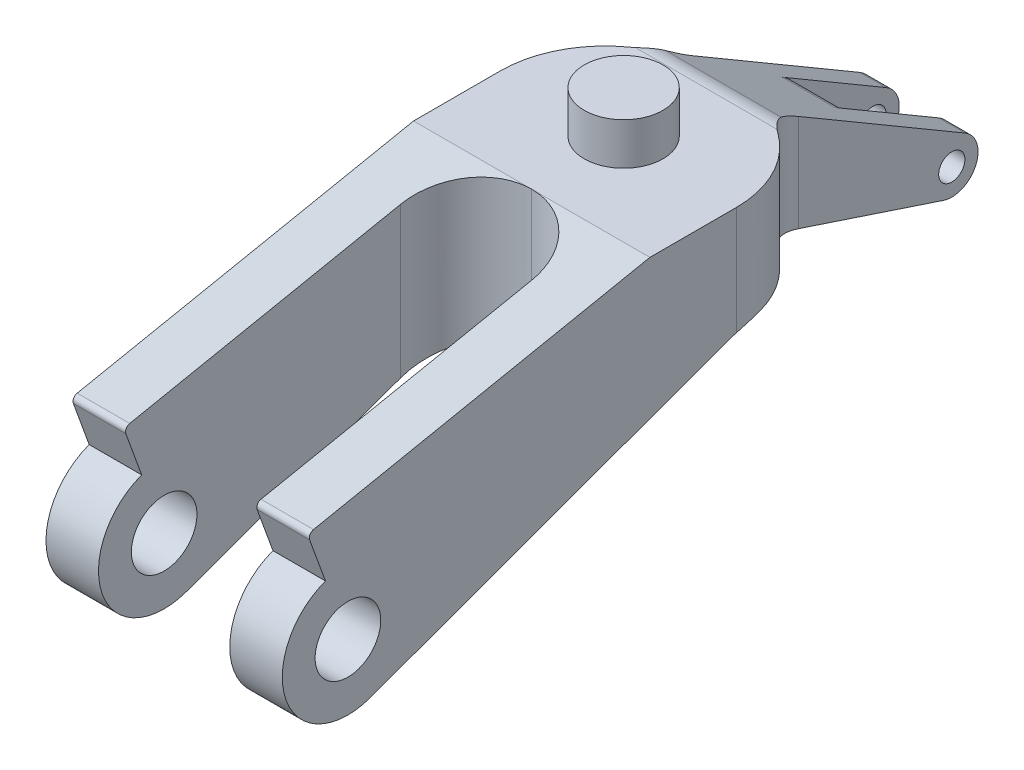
ISO-10303-21;
HEADER;
FILE_DESCRIPTION(('STEP AP214'),'2;1');
FILE_NAME('part.step','',(''),(''),'','','');
FILE_SCHEMA(('AUTOMOTIVE_DESIGN { 1 0 10303 214 1 1 1 1 }'));
ENDSEC;
DATA;
#1=APPLICATION_CONTEXT('core data for automotive mechanical design processes');
#2=APPLICATION_PROTOCOL_DEFINITION('international standard','automotive_design',2000,#1);
#3=PRODUCT_CONTEXT('',#1,'mechanical');
#4=PRODUCT('Part','Part','',(#3));
#5=PRODUCT_RELATED_PRODUCT_CATEGORY('part','',(#4));
#6=PRODUCT_DEFINITION_FORMATION('','',#4);
#7=PRODUCT_DEFINITION_CONTEXT('part definition',#1,'design');
#8=PRODUCT_DEFINITION('design','',#6,#7);
#9=PRODUCT_DEFINITION_SHAPE('','',#8);
#10=(LENGTH_UNIT() NAMED_UNIT(*) SI_UNIT(.MILLI.,.METRE.));
#11=(NAMED_UNIT(*) PLANE_ANGLE_UNIT() SI_UNIT($,.RADIAN.));
#12=(NAMED_UNIT(*) SI_UNIT($,.STERADIAN.) SOLID_ANGLE_UNIT());
#13=UNCERTAINTY_MEASURE_WITH_UNIT(LENGTH_MEASURE(1.E-05),#10,'distance_accuracy_value','');
#14=(GEOMETRIC_REPRESENTATION_CONTEXT(3) GLOBAL_UNCERTAINTY_ASSIGNED_CONTEXT((#13)) GLOBAL_UNIT_ASSIGNED_CONTEXT((#10,
#11,#12)) REPRESENTATION_CONTEXT('',''));
#15=CARTESIAN_POINT('',(0.,0.,0.));
#16=DIRECTION('',(0.,0.,1.));
#17=DIRECTION('',(1.,0.,0.));
#18=AXIS2_PLACEMENT_3D('',#15,#16,#17);
#19=CARTESIAN_POINT('',(0.,80.,0.));
#20=DIRECTION('',(0.,-1.,0.));
#21=DIRECTION('',(0.,0.,-1.));
#22=AXIS2_PLACEMENT_3D('',#19,#20,#21);
#23=CYLINDRICAL_SURFACE('',#22,75.);
#24=CARTESIAN_POINT('',(0.,80.,0.));
#25=DIRECTION('',(0.,1.,0.));
#26=DIRECTION('',(0.,0.,1.));
#27=AXIS2_PLACEMENT_3D('',#24,#25,#26);
#28=CIRCLE('',#27,75.);
#29=CARTESIAN_POINT('',(0.,80.,75.));
#30=VERTEX_POINT('',#29);
#31=EDGE_CURVE('E438',#30,#30,#28,.T.);
#32=ORIENTED_EDGE('',*,*,#31,.F.);
#33=EDGE_LOOP('',(#32));
#34=FACE_BOUND('',#33,.T.);
#35=CARTESIAN_POINT('',(0.,0.,0.));
#36=DIRECTION('',(0.,1.,0.));
#37=DIRECTION('',(0.,0.,1.));
#38=AXIS2_PLACEMENT_3D('',#35,#36,#37);
#39=CIRCLE('',#38,75.);
#40=CARTESIAN_POINT('',(0.,0.,75.));
#41=VERTEX_POINT('',#40);
#42=EDGE_CURVE('E437',#41,#41,#39,.T.);
#43=ORIENTED_EDGE('',*,*,#42,.T.);
#44=EDGE_LOOP('',(#43));
#45=FACE_BOUND('',#44,.T.);
#46=ADVANCED_FACE('F75',(#34,#45),#23,.T.);
#47=CARTESIAN_POINT('',(0.,80.,0.));
#48=DIRECTION('',(0.,1.,0.));
#49=DIRECTION('',(0.,0.,1.));
#50=AXIS2_PLACEMENT_3D('',#47,#48,#49);
#51=PLANE('',#50);
#52=ORIENTED_EDGE('',*,*,#31,.T.);
#53=EDGE_LOOP('',(#52));
#54=FACE_BOUND('',#53,.T.);
#55=ADVANCED_FACE('F721',(#54),#51,.T.);
#56=CARTESIAN_POINT('',(125.,0.,0.));
#57=DIRECTION('',(0.,1.,0.));
#58=DIRECTION('',(0.,0.,1.));
#59=AXIS2_PLACEMENT_3D('',#56,#57,#58);
#60=PLANE('',#59);
#61=ORIENTED_EDGE('',*,*,#42,.F.);
#62=EDGE_LOOP('',(#61));
#63=FACE_BOUND('',#62,.T.);
#64=CARTESIAN_POINT('',(200.,0.,-233.264896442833));
#65=DIRECTION('',(0.,1.,0.));
#66=DIRECTION('',(0.,0.,1.));
#67=AXIS2_PLACEMENT_3D('',#64,#65,#66);
#68=CIRCLE('',#67,100.);
#69=CARTESIAN_POINT('',(141.666666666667,0.,-152.041610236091));
#70=VERTEX_POINT('',#69);
#71=CARTESIAN_POINT('',(134.911528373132,0.,-157.347238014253));
#72=VERTEX_POINT('',#71);
#73=EDGE_CURVE('E605',#70,#72,#68,.F.);
#74=ORIENTED_EDGE('',*,*,#73,.T.);
#75=DIRECTION('',(-1.,0.,0.));
#76=VECTOR('',#75,1.);
#77=CARTESIAN_POINT('',(125.,0.,-157.347238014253));
#78=LINE('',#77,#76);
#79=CARTESIAN_POINT('',(-134.911528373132,0.,-157.347238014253));
#80=VERTEX_POINT('',#79);
#81=EDGE_CURVE('E566',#72,#80,#78,.T.);
#82=ORIENTED_EDGE('',*,*,#81,.T.);
#83=CARTESIAN_POINT('',(-200.,0.,-233.264896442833));
#84=DIRECTION('',(0.,1.,0.));
#85=DIRECTION('',(0.,0.,1.));
#86=AXIS2_PLACEMENT_3D('',#83,#84,#85);
#87=CIRCLE('',#86,100.);
#88=CARTESIAN_POINT('',(-141.666666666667,0.,-152.041610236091));
#89=VERTEX_POINT('',#88);
#90=EDGE_CURVE('E603',#80,#89,#87,.F.);
#91=ORIENTED_EDGE('',*,*,#90,.T.);
#92=CARTESIAN_POINT('',(-25.,0.,10.4049621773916));
#93=DIRECTION('',(0.,1.,0.));
#94=DIRECTION('',(0.,0.,1.));
#95=AXIS2_PLACEMENT_3D('',#92,#93,#94);
#96=CIRCLE('',#95,200.);
#97=CARTESIAN_POINT('',(-225.,0.,10.4049621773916));
#98=VERTEX_POINT('',#97);
#99=EDGE_CURVE('E493',#89,#98,#96,.T.);
#100=ORIENTED_EDGE('',*,*,#99,.T.);
#101=DIRECTION('',(0.,0.,-1.));
#102=VECTOR('',#101,1.);
#103=CARTESIAN_POINT('',(-225.,0.,0.));
#104=LINE('',#103,#102);
#105=CARTESIAN_POINT('',(-225.,0.,175.));
#106=VERTEX_POINT('',#105);
#107=EDGE_CURVE('E380',#106,#98,#104,.T.);
#108=ORIENTED_EDGE('',*,*,#107,.F.);
#109=DIRECTION('',(1.,0.,0.));
#110=VECTOR('',#109,1.);
#111=CARTESIAN_POINT('',(-225.,0.,175.));
#112=LINE('',#111,#110);
#113=CARTESIAN_POINT('',(0.,0.,175.));
#114=VERTEX_POINT('',#113);
#115=EDGE_CURVE('E401',#106,#114,#112,.T.);
#116=ORIENTED_EDGE('',*,*,#115,.T.);
#117=DIRECTION('',(-1.,0.,0.));
#118=VECTOR('',#117,1.);
#119=CARTESIAN_POINT('',(225.,0.,175.));
#120=LINE('',#119,#118);
#121=CARTESIAN_POINT('',(225.,0.,175.));
#122=VERTEX_POINT('',#121);
#123=EDGE_CURVE('E431',#122,#114,#120,.T.);
#124=ORIENTED_EDGE('',*,*,#123,.F.);
#125=DIRECTION('',(0.,0.,1.));
#126=VECTOR('',#125,1.);
#127=CARTESIAN_POINT('',(225.,0.,0.));
#128=LINE('',#127,#126);
#129=CARTESIAN_POINT('',(225.,0.,10.4049621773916));
#130=VERTEX_POINT('',#129);
#131=EDGE_CURVE('E412',#130,#122,#128,.T.);
#132=ORIENTED_EDGE('',*,*,#131,.F.);
#133=CARTESIAN_POINT('',(25.,0.,10.4049621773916));
#134=DIRECTION('',(0.,1.,0.));
#135=DIRECTION('',(0.,0.,1.));
#136=AXIS2_PLACEMENT_3D('',#133,#134,#135);
#137=CIRCLE('',#136,200.);
#138=EDGE_CURVE('E490',#130,#70,#137,.T.);
#139=ORIENTED_EDGE('',*,*,#138,.T.);
#140=EDGE_LOOP('',(#74,#82,#91,#100,#108,#116,#124,#132,#139));
#141=FACE_BOUND('',#140,.T.);
#142=ADVANCED_FACE('F602',(#63,#141),#60,.T.);
#143=CARTESIAN_POINT('',(125.,-178.679239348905,-65.033924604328));
#144=DIRECTION('',(0.,-0.939692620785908,-0.342020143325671));
#145=DIRECTION('',(0.,0.342020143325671,-0.939692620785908));
#146=AXIS2_PLACEMENT_3D('',#143,#144,#145);
#147=PLANE('',#146);
#148=DIRECTION('',(0.,-0.342020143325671,0.939692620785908));
#149=VECTOR('',#148,1.);
#150=CARTESIAN_POINT('',(-225.,-178.679239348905,-65.033924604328));
#151=LINE('',#150,#149);
#152=CARTESIAN_POINT('',(-225.,-212.061475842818,26.683016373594));
#153=VERTEX_POINT('',#152);
#154=CARTESIAN_POINT('',(-225.,-459.766683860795,707.247482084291));
#155=VERTEX_POINT('',#154);
#156=EDGE_CURVE('E377',#153,#155,#151,.T.);
#157=ORIENTED_EDGE('',*,*,#156,.F.);
#158=DIRECTION('',(-1.,0.,0.));
#159=VECTOR('',#158,1.);
#160=CARTESIAN_POINT('',(225.,-212.061475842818,26.683016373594));
#161=LINE('',#160,#159);
#162=CARTESIAN_POINT('',(225.,-212.061475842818,26.683016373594));
#163=VERTEX_POINT('',#162);
#164=EDGE_CURVE('E497',#153,#163,#161,.F.);
#165=ORIENTED_EDGE('',*,*,#164,.T.);
#166=DIRECTION('',(0.,0.342020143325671,-0.939692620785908));
#167=VECTOR('',#166,1.);
#168=CARTESIAN_POINT('',(225.,-178.679239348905,-65.033924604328));
#169=LINE('',#168,#167);
#170=CARTESIAN_POINT('',(225.,-459.766683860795,707.247482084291));
#171=VERTEX_POINT('',#170);
#172=EDGE_CURVE('E408',#171,#163,#169,.T.);
#173=ORIENTED_EDGE('',*,*,#172,.F.);
#174=DIRECTION('',(-1.,0.,0.));
#175=VECTOR('',#174,1.);
#176=CARTESIAN_POINT('',(225.,-459.766683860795,707.247482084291));
#177=LINE('',#176,#175);
#178=CARTESIAN_POINT('',(125.,-459.766683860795,707.247482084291));
#179=VERTEX_POINT('',#178);
#180=EDGE_CURVE('E434',#171,#179,#177,.T.);
#181=ORIENTED_EDGE('',*,*,#180,.T.);
#182=DIRECTION('',(0.,0.342020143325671,-0.939692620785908));
#183=VECTOR('',#182,1.);
#184=CARTESIAN_POINT('',(125.,-178.679239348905,-65.033924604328));
#185=LINE('',#184,#183);
#186=CARTESIAN_POINT('',(125.,-311.540722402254,300.));
#187=VERTEX_POINT('',#186);
#188=EDGE_CURVE('E422',#179,#187,#185,.T.);
#189=ORIENTED_EDGE('',*,*,#188,.T.);
#190=CARTESIAN_POINT('',(0.,-311.540722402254,300.));
#191=DIRECTION('',(0.,-0.939692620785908,-0.342020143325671));
#192=DIRECTION('',(0.,0.342020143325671,-0.939692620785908));
#193=AXIS2_PLACEMENT_3D('',#190,#191,#192);
#194=ELLIPSE('',#193,133.022221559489,125.);
#195=CARTESIAN_POINT('',(0.,-266.044443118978,175.));
#196=VERTEX_POINT('',#195);
#197=EDGE_CURVE('E451',#187,#196,#194,.F.);
#198=ORIENTED_EDGE('',*,*,#197,.T.);
#199=CARTESIAN_POINT('',(0.,-311.540722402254,300.));
#200=DIRECTION('',(0.,-0.939692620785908,-0.342020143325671));
#201=DIRECTION('',(0.,-0.342020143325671,0.939692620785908));
#202=AXIS2_PLACEMENT_3D('',#199,#200,#201);
#203=ELLIPSE('',#202,133.022221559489,125.);
#204=CARTESIAN_POINT('',(-125.,-311.540722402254,300.));
#205=VERTEX_POINT('',#204);
#206=EDGE_CURVE('E456',#196,#205,#203,.F.);
#207=ORIENTED_EDGE('',*,*,#206,.T.);
#208=DIRECTION('',(0.,-0.342020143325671,0.939692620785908));
#209=VECTOR('',#208,1.);
#210=CARTESIAN_POINT('',(-125.,-178.679239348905,-65.033924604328));
#211=LINE('',#210,#209);
#212=CARTESIAN_POINT('',(-125.,-459.766683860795,707.247482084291));
#213=VERTEX_POINT('',#212);
#214=EDGE_CURVE('E392',#205,#213,#211,.T.);
#215=ORIENTED_EDGE('',*,*,#214,.T.);
#216=DIRECTION('',(1.,0.,0.));
#217=VECTOR('',#216,1.);
#218=CARTESIAN_POINT('',(-225.,-459.766683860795,707.247482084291));
#219=LINE('',#218,#217);
#220=EDGE_CURVE('E388',#155,#213,#219,.T.);
#221=ORIENTED_EDGE('',*,*,#220,.F.);
#222=EDGE_LOOP('',(#157,#165,#173,#181,#189,#198,#207,#215,#221));
#223=FACE_BOUND('',#222,.T.);
#224=ADVANCED_FACE('F762',(#223),#147,.T.);
#225=CARTESIAN_POINT('',(125.,-200.,0.));
#226=DIRECTION('',(0.,-1.,0.));
#227=DIRECTION('',(0.,0.,-1.));
#228=AXIS2_PLACEMENT_3D('',#225,#226,#227);
#229=PLANE('',#228);
#230=CARTESIAN_POINT('',(-25.,-200.,10.4049621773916));
#231=DIRECTION('',(0.,-1.,0.));
#232=DIRECTION('',(0.,0.,-1.));
#233=AXIS2_PLACEMENT_3D('',#230,#231,#232);
#234=CIRCLE('',#233,200.);
#235=CARTESIAN_POINT('',(-218.087759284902,-200.,-41.7210122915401));
#236=VERTEX_POINT('',#235);
#237=CARTESIAN_POINT('',(-141.666666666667,-200.,-152.041610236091));
#238=VERTEX_POINT('',#237);
#239=EDGE_CURVE('E487',#236,#238,#234,.T.);
#240=ORIENTED_EDGE('',*,*,#239,.T.);
#241=CARTESIAN_POINT('',(-200.,-200.,-233.264896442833));
#242=DIRECTION('',(0.,-1.,0.));
#243=DIRECTION('',(0.,0.,-1.));
#244=AXIS2_PLACEMENT_3D('',#241,#242,#243);
#245=CIRCLE('',#244,100.);
#246=CARTESIAN_POINT('',(-133.169092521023,-200.,-158.876525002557));
#247=VERTEX_POINT('',#246);
#248=EDGE_CURVE('E611',#238,#247,#245,.F.);
#249=ORIENTED_EDGE('',*,*,#248,.T.);
#250=DIRECTION('',(-1.,0.,0.));
#251=VECTOR('',#250,1.);
#252=CARTESIAN_POINT('',(125.,-200.,-158.876525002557));
#253=LINE('',#252,#251);
#254=CARTESIAN_POINT('',(133.169092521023,-200.,-158.876525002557));
#255=VERTEX_POINT('',#254);
#256=EDGE_CURVE('E632',#247,#255,#253,.F.);
#257=ORIENTED_EDGE('',*,*,#256,.T.);
#258=CARTESIAN_POINT('',(200.,-200.,-233.264896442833));
#259=DIRECTION('',(0.,-1.,0.));
#260=DIRECTION('',(0.,0.,-1.));
#261=AXIS2_PLACEMENT_3D('',#258,#259,#260);
#262=CIRCLE('',#261,100.);
#263=CARTESIAN_POINT('',(141.666666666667,-200.,-152.041610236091));
#264=VERTEX_POINT('',#263);
#265=EDGE_CURVE('E588',#255,#264,#262,.F.);
#266=ORIENTED_EDGE('',*,*,#265,.T.);
#267=CARTESIAN_POINT('',(25.,-200.,10.4049621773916));
#268=DIRECTION('',(0.,-1.,0.));
#269=DIRECTION('',(0.,0.,-1.));
#270=AXIS2_PLACEMENT_3D('',#267,#268,#269);
#271=CIRCLE('',#270,200.);
#272=CARTESIAN_POINT('',(218.087759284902,-200.,-41.7210122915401));
#273=VERTEX_POINT('',#272);
#274=EDGE_CURVE('E485',#264,#273,#271,.T.);
#275=ORIENTED_EDGE('',*,*,#274,.T.);
#276=DIRECTION('',(-1.,0.,0.));
#277=VECTOR('',#276,1.);
#278=CARTESIAN_POINT('',(-225.,-200.,-41.7210122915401));
#279=LINE('',#278,#277);
#280=EDGE_CURVE('E483',#273,#236,#279,.T.);
#281=ORIENTED_EDGE('',*,*,#280,.T.);
#282=EDGE_LOOP('',(#240,#249,#257,#266,#275,#281));
#283=FACE_BOUND('',#282,.T.);
#284=ADVANCED_FACE('F630',(#283),#229,.T.);
#285=CARTESIAN_POINT('',(225.,-342.305106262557,750.));
#286=DIRECTION('',(-1.,0.,0.));
#287=DIRECTION('',(0.,0.,1.));
#288=AXIS2_PLACEMENT_3D('',#285,#286,#287);
#289=CYLINDRICAL_SURFACE('',#288,125.);
#290=CARTESIAN_POINT('',(125.,-342.305106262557,750.));
#291=DIRECTION('',(1.,0.,0.));
#292=DIRECTION('',(0.,0.,-1.));
#293=AXIS2_PLACEMENT_3D('',#290,#291,#292);
#294=CIRCLE('',#293,125.);
#295=CARTESIAN_POINT('',(125.,-224.843528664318,792.752517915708));
#296=VERTEX_POINT('',#295);
#297=EDGE_CURVE('E400',#296,#179,#294,.T.);
#298=ORIENTED_EDGE('',*,*,#297,.T.);
#299=ORIENTED_EDGE('',*,*,#180,.F.);
#300=CARTESIAN_POINT('',(225.,-342.305106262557,750.));
#301=DIRECTION('',(1.,0.,0.));
#302=DIRECTION('',(0.,0.,-1.));
#303=AXIS2_PLACEMENT_3D('',#300,#301,#302);
#304=CIRCLE('',#303,125.);
#305=CARTESIAN_POINT('',(225.,-224.843528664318,792.752517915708));
#306=VERTEX_POINT('',#305);
#307=EDGE_CURVE('E405',#306,#171,#304,.T.);
#308=ORIENTED_EDGE('',*,*,#307,.F.);
#309=DIRECTION('',(-1.,0.,0.));
#310=VECTOR('',#309,1.);
#311=CARTESIAN_POINT('',(225.,-224.843528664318,792.752517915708));
#312=LINE('',#311,#310);
#313=EDGE_CURVE('E419',#306,#296,#312,.T.);
#314=ORIENTED_EDGE('',*,*,#313,.T.);
#315=EDGE_LOOP('',(#298,#299,#308,#314));
#316=FACE_BOUND('',#315,.T.);
#317=ADVANCED_FACE('F692',(#316),#289,.T.);
#318=CARTESIAN_POINT('',(225.,33.7689540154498,6.77882715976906));
#319=DIRECTION('',(0.,-0.980440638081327,-0.196815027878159));
#320=DIRECTION('',(0.,0.196815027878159,-0.980440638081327));
#321=AXIS2_PLACEMENT_3D('',#318,#319,#320);
#322=PLANE('',#321);
#323=DIRECTION('',(0.,-0.196815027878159,0.980440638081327));
#324=VECTOR('',#323,1.);
#325=CARTESIAN_POINT('',(125.,33.7689540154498,6.77882715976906));
#326=LINE('',#325,#324);
#327=CARTESIAN_POINT('',(125.,-25.0926752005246,300.));
#328=VERTEX_POINT('',#327);
#329=CARTESIAN_POINT('',(125.,-128.584091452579,815.545948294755));
#330=VERTEX_POINT('',#329);
#331=EDGE_CURVE('E425',#328,#330,#326,.T.);
#332=ORIENTED_EDGE('',*,*,#331,.T.);
#333=DIRECTION('',(-1.,0.,0.));
#334=VECTOR('',#333,1.);
#335=CARTESIAN_POINT('',(225.,-128.584091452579,815.545948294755));
#336=LINE('',#335,#334);
#337=CARTESIAN_POINT('',(225.,-128.584091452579,815.545948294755));
#338=VERTEX_POINT('',#337);
#339=EDGE_CURVE('E467',#330,#338,#336,.F.);
#340=ORIENTED_EDGE('',*,*,#339,.T.);
#341=DIRECTION('',(0.,-0.196815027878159,0.980440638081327));
#342=VECTOR('',#341,1.);
#343=CARTESIAN_POINT('',(225.,33.7689540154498,6.77882715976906));
#344=LINE('',#343,#342);
#345=EDGE_CURVE('E414',#122,#338,#344,.T.);
#346=ORIENTED_EDGE('',*,*,#345,.F.);
#347=ORIENTED_EDGE('',*,*,#123,.T.);
#348=CARTESIAN_POINT('',(0.,-25.0926752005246,300.));
#349=DIRECTION('',(0.,-0.980440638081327,-0.196815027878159));
#350=DIRECTION('',(0.,0.196815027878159,-0.980440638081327));
#351=AXIS2_PLACEMENT_3D('',#348,#349,#350);
#352=ELLIPSE('',#351,127.493695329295,125.);
#353=EDGE_CURVE('E449',#114,#328,#352,.T.);
#354=ORIENTED_EDGE('',*,*,#353,.T.);
#355=EDGE_LOOP('',(#332,#340,#346,#347,#354));
#356=FACE_BOUND('',#355,.T.);
#357=ADVANCED_FACE('F672',(#356),#322,.F.);
#358=CARTESIAN_POINT('',(225.,-281.08744451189,772.281406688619));
#359=DIRECTION('',(0.,0.34202014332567,-0.939692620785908));
#360=DIRECTION('',(0.,0.939692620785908,0.34202014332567));
#361=AXIS2_PLACEMENT_3D('',#358,#359,#360);
#362=PLANE('',#361);
#363=DIRECTION('',(0.,-0.939692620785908,-0.34202014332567));
#364=VECTOR('',#363,1.);
#365=CARTESIAN_POINT('',(225.,-281.08744451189,772.281406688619));
#366=LINE('',#365,#364);
#367=CARTESIAN_POINT('',(225.,-141.808699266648,822.974724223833));
#368=VERTEX_POINT('',#367);
#369=EDGE_CURVE('E417',#368,#306,#366,.T.);
#370=ORIENTED_EDGE('',*,*,#369,.F.);
#371=DIRECTION('',(-1.,0.,0.));
#372=VECTOR('',#371,1.);
#373=CARTESIAN_POINT('',(225.,-141.808699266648,822.974724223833));
#374=LINE('',#373,#372);
#375=CARTESIAN_POINT('',(125.,-141.808699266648,822.974724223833));
#376=VERTEX_POINT('',#375);
#377=EDGE_CURVE('E458',#368,#376,#374,.T.);
#378=ORIENTED_EDGE('',*,*,#377,.T.);
#379=DIRECTION('',(0.,-0.939692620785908,-0.34202014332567));
#380=VECTOR('',#379,1.);
#381=CARTESIAN_POINT('',(125.,-281.08744451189,772.281406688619));
#382=LINE('',#381,#380);
#383=EDGE_CURVE('E409',#376,#296,#382,.T.);
#384=ORIENTED_EDGE('',*,*,#383,.T.);
#385=ORIENTED_EDGE('',*,*,#313,.F.);
#386=EDGE_LOOP('',(#370,#378,#384,#385));
#387=FACE_BOUND('',#386,.T.);
#388=ADVANCED_FACE('F685',(#387),#362,.F.);
#389=CARTESIAN_POINT('',(225.,-342.305106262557,750.));
#390=DIRECTION('',(1.,0.,0.));
#391=DIRECTION('',(0.,0.,-1.));
#392=AXIS2_PLACEMENT_3D('',#389,#390,#391);
#393=PLANE('',#392);
#394=CARTESIAN_POINT('',(225.,-342.305106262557,750.));
#395=DIRECTION('',(1.,0.,0.));
#396=DIRECTION('',(0.,0.,-1.));
#397=AXIS2_PLACEMENT_3D('',#394,#395,#396);
#398=CIRCLE('',#397,62.5);
#399=CARTESIAN_POINT('',(225.,-342.305106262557,687.5));
#400=VERTEX_POINT('',#399);
#401=EDGE_CURVE('E361',#400,#400,#398,.T.);
#402=ORIENTED_EDGE('',*,*,#401,.F.);
#403=EDGE_LOOP('',(#402));
#404=FACE_BOUND('',#403,.T.);
#405=ORIENTED_EDGE('',*,*,#172,.T.);
#406=CARTESIAN_POINT('',(225.,-400.,-41.7210122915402));
#407=DIRECTION('',(1.,0.,0.));
#408=DIRECTION('',(0.,0.,-1.));
#409=AXIS2_PLACEMENT_3D('',#406,#407,#408);
#410=CIRCLE('',#409,200.);
#411=CARTESIAN_POINT('',(225.,-206.912240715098,10.4049621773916));
#412=VERTEX_POINT('',#411);
#413=EDGE_CURVE('E505',#163,#412,#410,.F.);
#414=ORIENTED_EDGE('',*,*,#413,.T.);
#415=DIRECTION('',(0.,1.,0.));
#416=VECTOR('',#415,1.);
#417=CARTESIAN_POINT('',(225.,0.,10.4049621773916));
#418=LINE('',#417,#416);
#419=CARTESIAN_POINT('',(225.,-206.136748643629,10.4049621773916));
#420=VERTEX_POINT('',#419);
#421=EDGE_CURVE('E501',#412,#420,#418,.T.);
#422=ORIENTED_EDGE('',*,*,#421,.T.);
#423=DIRECTION('',(0.,1.,0.));
#424=VECTOR('',#423,1.);
#425=CARTESIAN_POINT('',(225.,0.,10.4049621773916));
#426=LINE('',#425,#424);
#427=EDGE_CURVE('E495',#420,#130,#426,.T.);
#428=ORIENTED_EDGE('',*,*,#427,.T.);
#429=ORIENTED_EDGE('',*,*,#131,.T.);
#430=ORIENTED_EDGE('',*,*,#345,.T.);
#431=CARTESIAN_POINT('',(225.,-138.388497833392,813.577798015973));
#432=DIRECTION('',(1.,0.,0.));
#433=DIRECTION('',(0.,0.,-1.));
#434=AXIS2_PLACEMENT_3D('',#431,#432,#433);
#435=CIRCLE('',#434,10.);
#436=EDGE_CURVE('E469',#338,#368,#435,.T.);
#437=ORIENTED_EDGE('',*,*,#436,.T.);
#438=ORIENTED_EDGE('',*,*,#369,.T.);
#439=ORIENTED_EDGE('',*,*,#307,.T.);
#440=EDGE_LOOP('',(#405,#414,#422,#428,#429,#430,#437,#438,#439));
#441=FACE_BOUND('',#440,.T.);
#442=ADVANCED_FACE('F678',(#404,#441),#393,.T.);
#443=CARTESIAN_POINT('',(125.,-342.305106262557,750.));
#444=DIRECTION('',(1.,0.,0.));
#445=DIRECTION('',(0.,0.,-1.));
#446=AXIS2_PLACEMENT_3D('',#443,#444,#445);
#447=PLANE('',#446);
#448=CARTESIAN_POINT('',(125.,-342.305106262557,750.));
#449=DIRECTION('',(1.,0.,0.));
#450=DIRECTION('',(0.,0.,-1.));
#451=AXIS2_PLACEMENT_3D('',#448,#449,#450);
#452=CIRCLE('',#451,62.5);
#453=CARTESIAN_POINT('',(125.,-342.305106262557,687.5));
#454=VERTEX_POINT('',#453);
#455=EDGE_CURVE('E370',#454,#454,#452,.T.);
#456=ORIENTED_EDGE('',*,*,#455,.T.);
#457=EDGE_LOOP('',(#456));
#458=FACE_BOUND('',#457,.T.);
#459=ORIENTED_EDGE('',*,*,#383,.F.);
#460=CARTESIAN_POINT('',(125.,-138.388497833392,813.577798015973));
#461=DIRECTION('',(1.,0.,0.));
#462=DIRECTION('',(0.,0.,-1.));
#463=AXIS2_PLACEMENT_3D('',#460,#461,#462);
#464=CIRCLE('',#463,10.);
#465=EDGE_CURVE('E465',#376,#330,#464,.F.);
#466=ORIENTED_EDGE('',*,*,#465,.T.);
#467=ORIENTED_EDGE('',*,*,#331,.F.);
#468=DIRECTION('',(0.,1.,0.));
#469=VECTOR('',#468,1.);
#470=CARTESIAN_POINT('',(125.,-342.305106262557,300.));
#471=LINE('',#470,#469);
#472=EDGE_CURVE('E441',#328,#187,#471,.F.);
#473=ORIENTED_EDGE('',*,*,#472,.T.);
#474=ORIENTED_EDGE('',*,*,#188,.F.);
#475=ORIENTED_EDGE('',*,*,#297,.F.);
#476=EDGE_LOOP('',(#459,#466,#467,#473,#474,#475));
#477=FACE_BOUND('',#476,.T.);
#478=ADVANCED_FACE('F689',(#458,#477),#447,.F.);
#479=CARTESIAN_POINT('',(-225.,-342.305106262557,750.));
#480=DIRECTION('',(1.,0.,0.));
#481=DIRECTION('',(0.,0.,-1.));
#482=AXIS2_PLACEMENT_3D('',#479,#480,#481);
#483=CYLINDRICAL_SURFACE('',#482,125.);
#484=CARTESIAN_POINT('',(-125.,-342.305106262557,750.));
#485=DIRECTION('',(1.,0.,0.));
#486=DIRECTION('',(0.,0.,-1.));
#487=AXIS2_PLACEMENT_3D('',#484,#485,#486);
#488=CIRCLE('',#487,125.);
#489=CARTESIAN_POINT('',(-125.,-224.843528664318,792.752517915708));
#490=VERTEX_POINT('',#489);
#491=EDGE_CURVE('E389',#490,#213,#488,.T.);
#492=ORIENTED_EDGE('',*,*,#491,.F.);
#493=DIRECTION('',(1.,0.,0.));
#494=VECTOR('',#493,1.);
#495=CARTESIAN_POINT('',(-225.,-224.843528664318,792.752517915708));
#496=LINE('',#495,#494);
#497=CARTESIAN_POINT('',(-225.,-224.843528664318,792.752517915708));
#498=VERTEX_POINT('',#497);
#499=EDGE_CURVE('E398',#498,#490,#496,.T.);
#500=ORIENTED_EDGE('',*,*,#499,.F.);
#501=CARTESIAN_POINT('',(-225.,-342.305106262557,750.));
#502=DIRECTION('',(1.,0.,0.));
#503=DIRECTION('',(0.,0.,-1.));
#504=AXIS2_PLACEMENT_3D('',#501,#502,#503);
#505=CIRCLE('',#504,125.);
#506=EDGE_CURVE('E374',#498,#155,#505,.T.);
#507=ORIENTED_EDGE('',*,*,#506,.T.);
#508=ORIENTED_EDGE('',*,*,#220,.T.);
#509=EDGE_LOOP('',(#492,#500,#507,#508));
#510=FACE_BOUND('',#509,.T.);
#511=ADVANCED_FACE('F766',(#510),#483,.T.);
#512=CARTESIAN_POINT('',(-225.,-281.08744451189,772.281406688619));
#513=DIRECTION('',(0.,0.34202014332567,-0.939692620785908));
#514=DIRECTION('',(0.,0.939692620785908,0.34202014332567));
#515=AXIS2_PLACEMENT_3D('',#512,#513,#514);
#516=PLANE('',#515);
#517=DIRECTION('',(0.,0.939692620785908,0.34202014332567));
#518=VECTOR('',#517,1.);
#519=CARTESIAN_POINT('',(-125.,-281.08744451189,772.281406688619));
#520=LINE('',#519,#518);
#521=CARTESIAN_POINT('',(-125.,-141.808699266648,822.974724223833));
#522=VERTEX_POINT('',#521);
#523=EDGE_CURVE('E378',#490,#522,#520,.T.);
#524=ORIENTED_EDGE('',*,*,#523,.T.);
#525=DIRECTION('',(1.,0.,0.));
#526=VECTOR('',#525,1.);
#527=CARTESIAN_POINT('',(-225.,-141.808699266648,822.974724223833));
#528=LINE('',#527,#526);
#529=CARTESIAN_POINT('',(-225.,-141.808699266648,822.974724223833));
#530=VERTEX_POINT('',#529);
#531=EDGE_CURVE('E476',#522,#530,#528,.F.);
#532=ORIENTED_EDGE('',*,*,#531,.T.);
#533=DIRECTION('',(0.,0.939692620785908,0.34202014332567));
#534=VECTOR('',#533,1.);
#535=CARTESIAN_POINT('',(-225.,-281.08744451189,772.281406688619));
#536=LINE('',#535,#534);
#537=EDGE_CURVE('E385',#498,#530,#536,.T.);
#538=ORIENTED_EDGE('',*,*,#537,.F.);
#539=ORIENTED_EDGE('',*,*,#499,.T.);
#540=EDGE_LOOP('',(#524,#532,#538,#539));
#541=FACE_BOUND('',#540,.T.);
#542=ADVANCED_FACE('F769',(#541),#516,.F.);
#543=CARTESIAN_POINT('',(-225.,33.7689540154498,6.77882715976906));
#544=DIRECTION('',(0.,-0.980440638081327,-0.196815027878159));
#545=DIRECTION('',(0.,0.196815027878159,-0.980440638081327));
#546=AXIS2_PLACEMENT_3D('',#543,#544,#545);
#547=PLANE('',#546);
#548=DIRECTION('',(0.,0.196815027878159,-0.980440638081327));
#549=VECTOR('',#548,1.);
#550=CARTESIAN_POINT('',(-225.,33.7689540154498,6.77882715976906));
#551=LINE('',#550,#549);
#552=CARTESIAN_POINT('',(-225.,-128.584091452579,815.545948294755));
#553=VERTEX_POINT('',#552);
#554=EDGE_CURVE('E383',#553,#106,#551,.T.);
#555=ORIENTED_EDGE('',*,*,#554,.F.);
#556=DIRECTION('',(1.,0.,0.));
#557=VECTOR('',#556,1.);
#558=CARTESIAN_POINT('',(-225.,-128.584091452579,815.545948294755));
#559=LINE('',#558,#557);
#560=CARTESIAN_POINT('',(-125.,-128.584091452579,815.545948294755));
#561=VERTEX_POINT('',#560);
#562=EDGE_CURVE('E471',#553,#561,#559,.T.);
#563=ORIENTED_EDGE('',*,*,#562,.T.);
#564=DIRECTION('',(0.,0.196815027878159,-0.980440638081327));
#565=VECTOR('',#564,1.);
#566=CARTESIAN_POINT('',(-125.,33.7689540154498,6.77882715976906));
#567=LINE('',#566,#565);
#568=CARTESIAN_POINT('',(-125.,-25.0926752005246,300.));
#569=VERTEX_POINT('',#568);
#570=EDGE_CURVE('E394',#561,#569,#567,.T.);
#571=ORIENTED_EDGE('',*,*,#570,.T.);
#572=CARTESIAN_POINT('',(0.,-25.0926752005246,300.));
#573=DIRECTION('',(0.,-0.980440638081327,-0.196815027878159));
#574=DIRECTION('',(0.,-0.196815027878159,0.980440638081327));
#575=AXIS2_PLACEMENT_3D('',#572,#573,#574);
#576=ELLIPSE('',#575,127.493695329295,125.);
#577=EDGE_CURVE('E453',#569,#114,#576,.T.);
#578=ORIENTED_EDGE('',*,*,#577,.T.);
#579=ORIENTED_EDGE('',*,*,#115,.F.);
#580=EDGE_LOOP('',(#555,#563,#571,#578,#579));
#581=FACE_BOUND('',#580,.T.);
#582=ADVANCED_FACE('F665',(#581),#547,.F.);
#583=CARTESIAN_POINT('',(-225.,-342.305106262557,750.));
#584=DIRECTION('',(1.,0.,0.));
#585=DIRECTION('',(0.,0.,-1.));
#586=AXIS2_PLACEMENT_3D('',#583,#584,#585);
#587=PLANE('',#586);
#588=CARTESIAN_POINT('',(-225.,-342.305106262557,750.));
#589=DIRECTION('',(1.,0.,0.));
#590=DIRECTION('',(0.,0.,-1.));
#591=AXIS2_PLACEMENT_3D('',#588,#589,#590);
#592=CIRCLE('',#591,62.5);
#593=CARTESIAN_POINT('',(-225.,-342.305106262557,687.5));
#594=VERTEX_POINT('',#593);
#595=EDGE_CURVE('E366',#594,#594,#592,.T.);
#596=ORIENTED_EDGE('',*,*,#595,.T.);
#597=EDGE_LOOP('',(#596));
#598=FACE_BOUND('',#597,.T.);
#599=ORIENTED_EDGE('',*,*,#107,.T.);
#600=DIRECTION('',(0.,-1.,0.));
#601=VECTOR('',#600,1.);
#602=CARTESIAN_POINT('',(-225.,-342.305106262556,10.4049621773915));
#603=LINE('',#602,#601);
#604=CARTESIAN_POINT('',(-225.,-206.136748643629,10.4049621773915));
#605=VERTEX_POINT('',#604);
#606=EDGE_CURVE('E480',#98,#605,#603,.T.);
#607=ORIENTED_EDGE('',*,*,#606,.T.);
#608=DIRECTION('',(0.,-1.,0.));
#609=VECTOR('',#608,1.);
#610=CARTESIAN_POINT('',(-225.,-342.305106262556,10.4049621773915));
#611=LINE('',#610,#609);
#612=CARTESIAN_POINT('',(-225.,-206.912240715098,10.4049621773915));
#613=VERTEX_POINT('',#612);
#614=EDGE_CURVE('E499',#605,#613,#611,.T.);
#615=ORIENTED_EDGE('',*,*,#614,.T.);
#616=CARTESIAN_POINT('',(-225.,-400.,-41.7210122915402));
#617=DIRECTION('',(1.,0.,0.));
#618=DIRECTION('',(0.,0.,-1.));
#619=AXIS2_PLACEMENT_3D('',#616,#617,#618);
#620=CIRCLE('',#619,200.);
#621=EDGE_CURVE('E503',#613,#153,#620,.T.);
#622=ORIENTED_EDGE('',*,*,#621,.T.);
#623=ORIENTED_EDGE('',*,*,#156,.T.);
#624=ORIENTED_EDGE('',*,*,#506,.F.);
#625=ORIENTED_EDGE('',*,*,#537,.T.);
#626=CARTESIAN_POINT('',(-225.,-138.388497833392,813.577798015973));
#627=DIRECTION('',(1.,0.,0.));
#628=DIRECTION('',(0.,0.,-1.));
#629=AXIS2_PLACEMENT_3D('',#626,#627,#628);
#630=CIRCLE('',#629,10.);
#631=EDGE_CURVE('E478',#530,#553,#630,.F.);
#632=ORIENTED_EDGE('',*,*,#631,.T.);
#633=ORIENTED_EDGE('',*,*,#554,.T.);
#634=EDGE_LOOP('',(#599,#607,#615,#622,#623,#624,#625,#632,#633));
#635=FACE_BOUND('',#634,.T.);
#636=ADVANCED_FACE('F659',(#598,#635),#587,.F.);
#637=CARTESIAN_POINT('',(-125.,-342.305106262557,750.));
#638=DIRECTION('',(1.,0.,0.));
#639=DIRECTION('',(0.,0.,-1.));
#640=AXIS2_PLACEMENT_3D('',#637,#638,#639);
#641=PLANE('',#640);
#642=CARTESIAN_POINT('',(-125.,-342.305106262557,750.));
#643=DIRECTION('',(1.,0.,0.));
#644=DIRECTION('',(0.,0.,-1.));
#645=AXIS2_PLACEMENT_3D('',#642,#643,#644);
#646=CIRCLE('',#645,62.5);
#647=CARTESIAN_POINT('',(-125.,-342.305106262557,687.5));
#648=VERTEX_POINT('',#647);
#649=EDGE_CURVE('E369',#648,#648,#646,.T.);
#650=ORIENTED_EDGE('',*,*,#649,.F.);
#651=EDGE_LOOP('',(#650));
#652=FACE_BOUND('',#651,.T.);
#653=ORIENTED_EDGE('',*,*,#570,.F.);
#654=CARTESIAN_POINT('',(-125.,-138.388497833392,813.577798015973));
#655=DIRECTION('',(1.,0.,0.));
#656=DIRECTION('',(0.,0.,-1.));
#657=AXIS2_PLACEMENT_3D('',#654,#655,#656);
#658=CIRCLE('',#657,10.);
#659=EDGE_CURVE('E474',#561,#522,#658,.T.);
#660=ORIENTED_EDGE('',*,*,#659,.T.);
#661=ORIENTED_EDGE('',*,*,#523,.F.);
#662=ORIENTED_EDGE('',*,*,#491,.T.);
#663=ORIENTED_EDGE('',*,*,#214,.F.);
#664=DIRECTION('',(0.,1.,0.));
#665=VECTOR('',#664,1.);
#666=CARTESIAN_POINT('',(-125.,0.,300.));
#667=LINE('',#666,#665);
#668=EDGE_CURVE('E446',#205,#569,#667,.T.);
#669=ORIENTED_EDGE('',*,*,#668,.T.);
#670=EDGE_LOOP('',(#653,#660,#661,#662,#663,#669));
#671=FACE_BOUND('',#670,.T.);
#672=ADVANCED_FACE('F741',(#652,#671),#641,.T.);
#673=CARTESIAN_POINT('',(0.,-342.305106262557,300.));
#674=DIRECTION('',(0.,-1.,0.));
#675=DIRECTION('',(0.,0.,-1.));
#676=AXIS2_PLACEMENT_3D('',#673,#674,#675);
#677=CYLINDRICAL_SURFACE('',#676,125.);
#678=ORIENTED_EDGE('',*,*,#668,.F.);
#679=ORIENTED_EDGE('',*,*,#206,.F.);
#680=DIRECTION('',(0.,1.,0.));
#681=VECTOR('',#680,1.);
#682=CARTESIAN_POINT('',(0.,-266.044443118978,175.));
#683=LINE('',#682,#681);
#684=EDGE_CURVE('E373',#114,#196,#683,.F.);
#685=ORIENTED_EDGE('',*,*,#684,.F.);
#686=ORIENTED_EDGE('',*,*,#577,.F.);
#687=EDGE_LOOP('',(#678,#679,#685,#686));
#688=FACE_BOUND('',#687,.T.);
#689=ADVANCED_FACE('F737',(#688),#677,.F.);
#690=CARTESIAN_POINT('',(0.,0.,300.));
#691=DIRECTION('',(0.,1.,0.));
#692=DIRECTION('',(0.,0.,1.));
#693=AXIS2_PLACEMENT_3D('',#690,#691,#692);
#694=CYLINDRICAL_SURFACE('',#693,125.);
#695=ORIENTED_EDGE('',*,*,#197,.F.);
#696=ORIENTED_EDGE('',*,*,#472,.F.);
#697=ORIENTED_EDGE('',*,*,#353,.F.);
#698=ORIENTED_EDGE('',*,*,#684,.T.);
#699=EDGE_LOOP('',(#695,#696,#697,#698));
#700=FACE_BOUND('',#699,.T.);
#701=ADVANCED_FACE('F733',(#700),#694,.F.);
#702=CARTESIAN_POINT('',(-225.,-342.305106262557,750.));
#703=DIRECTION('',(1.,0.,0.));
#704=DIRECTION('',(0.,0.,-1.));
#705=AXIS2_PLACEMENT_3D('',#702,#703,#704);
#706=CYLINDRICAL_SURFACE('',#705,62.5);
#707=ORIENTED_EDGE('',*,*,#649,.T.);
#708=EDGE_LOOP('',(#707));
#709=FACE_BOUND('',#708,.T.);
#710=ORIENTED_EDGE('',*,*,#595,.F.);
#711=EDGE_LOOP('',(#710));
#712=FACE_BOUND('',#711,.T.);
#713=ADVANCED_FACE('F736',(#709,#712),#706,.F.);
#714=ORIENTED_EDGE('',*,*,#401,.T.);
#715=EDGE_LOOP('',(#714));
#716=FACE_BOUND('',#715,.T.);
#717=ORIENTED_EDGE('',*,*,#455,.F.);
#718=EDGE_LOOP('',(#717));
#719=FACE_BOUND('',#718,.T.);
#720=ADVANCED_FACE('F745',(#716,#719),#706,.F.);
#721=CARTESIAN_POINT('',(225.,-138.388497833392,813.577798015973));
#722=DIRECTION('',(-1.,0.,0.));
#723=DIRECTION('',(0.,0.,1.));
#724=AXIS2_PLACEMENT_3D('',#721,#722,#723);
#725=CYLINDRICAL_SURFACE('',#724,10.);
#726=ORIENTED_EDGE('',*,*,#436,.F.);
#727=ORIENTED_EDGE('',*,*,#339,.F.);
#728=ORIENTED_EDGE('',*,*,#465,.F.);
#729=ORIENTED_EDGE('',*,*,#377,.F.);
#730=EDGE_LOOP('',(#726,#727,#728,#729));
#731=FACE_BOUND('',#730,.T.);
#732=ADVANCED_FACE('F682',(#731),#725,.T.);
#733=CARTESIAN_POINT('',(-225.,-138.388497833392,813.577798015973));
#734=DIRECTION('',(1.,0.,0.));
#735=DIRECTION('',(0.,0.,-1.));
#736=AXIS2_PLACEMENT_3D('',#733,#734,#735);
#737=CYLINDRICAL_SURFACE('',#736,10.);
#738=ORIENTED_EDGE('',*,*,#631,.F.);
#739=ORIENTED_EDGE('',*,*,#531,.F.);
#740=ORIENTED_EDGE('',*,*,#659,.F.);
#741=ORIENTED_EDGE('',*,*,#562,.F.);
#742=EDGE_LOOP('',(#738,#739,#740,#741));
#743=FACE_BOUND('',#742,.T.);
#744=ADVANCED_FACE('F744',(#743),#737,.T.);
#745=CARTESIAN_POINT('',(100.,-128.028256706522,42.387131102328));
#746=DIRECTION('',(0.,0.949324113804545,-0.314298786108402));
#747=DIRECTION('',(0.,0.314298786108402,0.949324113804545));
#748=AXIS2_PLACEMENT_3D('',#745,#746,#747);
#749=PLANE('',#748);
#750=DIRECTION('',(0.,-0.314298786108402,-0.949324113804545));
#751=VECTOR('',#750,1.);
#752=CARTESIAN_POINT('',(-50.,-128.028256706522,42.3871311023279));
#753=LINE('',#752,#751);
#754=CARTESIAN_POINT('',(-50.,-238.56890317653,-291.495485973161));
#755=VERTEX_POINT('',#754);
#756=CARTESIAN_POINT('',(-50.,-310.673886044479,-509.28506069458));
#757=VERTEX_POINT('',#756);
#758=EDGE_CURVE('E301',#755,#757,#753,.T.);
#759=ORIENTED_EDGE('',*,*,#758,.F.);
#760=DIRECTION('',(-1.,0.,0.));
#761=VECTOR('',#760,1.);
#762=CARTESIAN_POINT('',(100.,-238.56890317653,-291.495485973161));
#763=LINE('',#762,#761);
#764=CARTESIAN_POINT('',(50.,-238.56890317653,-291.495485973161));
#765=VERTEX_POINT('',#764);
#766=EDGE_CURVE('E594',#755,#765,#763,.F.);
#767=ORIENTED_EDGE('',*,*,#766,.T.);
#768=DIRECTION('',(0.,0.314298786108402,0.949324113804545));
#769=VECTOR('',#768,1.);
#770=CARTESIAN_POINT('',(50.,-128.028256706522,42.3871311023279));
#771=LINE('',#770,#769);
#772=CARTESIAN_POINT('',(50.,-310.673886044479,-509.28506069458));
#773=VERTEX_POINT('',#772);
#774=EDGE_CURVE('E340',#773,#765,#771,.T.);
#775=ORIENTED_EDGE('',*,*,#774,.F.);
#776=DIRECTION('',(1.,0.,0.));
#777=VECTOR('',#776,1.);
#778=CARTESIAN_POINT('',(50.,-310.673886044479,-509.28506069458));
#779=LINE('',#778,#777);
#780=CARTESIAN_POINT('',(100.,-310.673886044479,-509.28506069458));
#781=VERTEX_POINT('',#780);
#782=EDGE_CURVE('E347',#773,#781,#779,.T.);
#783=ORIENTED_EDGE('',*,*,#782,.T.);
#784=DIRECTION('',(0.,-0.314298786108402,-0.949324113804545));
#785=VECTOR('',#784,1.);
#786=CARTESIAN_POINT('',(100.,-128.028256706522,42.387131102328));
#787=LINE('',#786,#785);
#788=CARTESIAN_POINT('',(100.,-219.290130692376,-233.264896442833));
#789=VERTEX_POINT('',#788);
#790=EDGE_CURVE('E356',#789,#781,#787,.T.);
#791=ORIENTED_EDGE('',*,*,#790,.F.);
#792=CARTESIAN_POINT('',(200.,-219.290130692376,-233.264896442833));
#793=DIRECTION('',(0.,0.949324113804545,-0.314298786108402));
#794=DIRECTION('',(0.,-0.314298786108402,-0.949324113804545));
#795=AXIS2_PLACEMENT_3D('',#792,#793,#794);
#796=ELLIPSE('',#795,105.338101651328,100.);
#797=CARTESIAN_POINT('',(109.697353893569,-205.067588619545,-190.306403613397));
#798=VERTEX_POINT('',#797);
#799=EDGE_CURVE('E625',#789,#798,#796,.T.);
#800=ORIENTED_EDGE('',*,*,#799,.T.);
#801=DIRECTION('',(-1.,0.,0.));
#802=VECTOR('',#801,1.);
#803=CARTESIAN_POINT('',(100.,-205.067588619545,-190.306403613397));
#804=LINE('',#803,#802);
#805=CARTESIAN_POINT('',(-109.697353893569,-205.067588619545,-190.306403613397));
#806=VERTEX_POINT('',#805);
#807=EDGE_CURVE('E507',#798,#806,#804,.T.);
#808=ORIENTED_EDGE('',*,*,#807,.T.);
#809=CARTESIAN_POINT('',(-200.,-219.290130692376,-233.264896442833));
#810=DIRECTION('',(0.,0.949324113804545,-0.314298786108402));
#811=DIRECTION('',(0.,-0.314298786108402,-0.949324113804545));
#812=AXIS2_PLACEMENT_3D('',#809,#810,#811);
#813=ELLIPSE('',#812,105.338101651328,100.);
#814=CARTESIAN_POINT('',(-100.,-219.290130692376,-233.264896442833));
#815=VERTEX_POINT('',#814);
#816=EDGE_CURVE('E615',#806,#815,#813,.T.);
#817=ORIENTED_EDGE('',*,*,#816,.T.);
#818=DIRECTION('',(0.,-0.314298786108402,-0.949324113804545));
#819=VECTOR('',#818,1.);
#820=CARTESIAN_POINT('',(-100.,-128.028256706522,42.387131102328));
#821=LINE('',#820,#819);
#822=CARTESIAN_POINT('',(-100.,-310.673886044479,-509.28506069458));
#823=VERTEX_POINT('',#822);
#824=EDGE_CURVE('E353',#815,#823,#821,.T.);
#825=ORIENTED_EDGE('',*,*,#824,.T.);
#826=DIRECTION('',(-1.,0.,0.));
#827=VECTOR('',#826,1.);
#828=CARTESIAN_POINT('',(-50.,-310.673886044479,-509.28506069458));
#829=LINE('',#828,#827);
#830=EDGE_CURVE('E314',#757,#823,#829,.T.);
#831=ORIENTED_EDGE('',*,*,#830,.F.);
#832=EDGE_LOOP('',(#759,#767,#775,#783,#791,#800,#808,#817,#825,#831));
#833=FACE_BOUND('',#832,.T.);
#834=ADVANCED_FACE('F646',(#833),#749,.F.);
#835=CARTESIAN_POINT('',(100.,-178.533156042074,-382.865588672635));
#836=DIRECTION('',(0.,0.422618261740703,0.906307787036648));
#837=DIRECTION('',(0.,-0.906307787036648,0.422618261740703));
#838=AXIS2_PLACEMENT_3D('',#835,#836,#837);
#839=PLANE('',#838);
#840=DIRECTION('',(0.,0.906307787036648,-0.422618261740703));
#841=VECTOR('',#840,1.);
#842=CARTESIAN_POINT('',(-50.,-178.533156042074,-382.865588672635));
#843=LINE('',#842,#841);
#844=CARTESIAN_POINT('',(-50.,-204.33302279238,-370.834913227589));
#845=VERTEX_POINT('',#844);
#846=CARTESIAN_POINT('',(-50.,-187.672446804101,-378.603867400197));
#847=VERTEX_POINT('',#846);
#848=EDGE_CURVE('E320',#845,#847,#843,.T.);
#849=ORIENTED_EDGE('',*,*,#848,.T.);
#850=DIRECTION('',(-1.,0.,0.));
#851=VECTOR('',#850,1.);
#852=CARTESIAN_POINT('',(50.,-187.672446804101,-378.603867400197));
#853=LINE('',#852,#851);
#854=CARTESIAN_POINT('',(50.,-187.672446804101,-378.603867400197));
#855=VERTEX_POINT('',#854);
#856=EDGE_CURVE('E593',#847,#855,#853,.F.);
#857=ORIENTED_EDGE('',*,*,#856,.T.);
#858=DIRECTION('',(0.,-0.906307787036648,0.422618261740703));
#859=VECTOR('',#858,1.);
#860=CARTESIAN_POINT('',(50.,-178.533156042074,-382.865588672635));
#861=LINE('',#860,#859);
#862=CARTESIAN_POINT('',(50.,-204.33302279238,-370.834913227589));
#863=VERTEX_POINT('',#862);
#864=EDGE_CURVE('E337',#855,#863,#861,.T.);
#865=ORIENTED_EDGE('',*,*,#864,.T.);
#866=DIRECTION('',(-1.,0.,0.));
#867=VECTOR('',#866,1.);
#868=CARTESIAN_POINT('',(100.,-204.33302279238,-370.834913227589));
#869=LINE('',#868,#867);
#870=EDGE_CURVE('E590',#863,#845,#869,.T.);
#871=ORIENTED_EDGE('',*,*,#870,.T.);
#872=EDGE_LOOP('',(#849,#857,#865,#871));
#873=FACE_BOUND('',#872,.T.);
#874=ADVANCED_FACE('F751',(#873),#839,.F.);
#875=CARTESIAN_POINT('',(100.,76.3627007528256,-44.7801224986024));
#876=DIRECTION('',(0.,0.862620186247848,-0.505852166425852));
#877=DIRECTION('',(0.,0.505852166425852,0.862620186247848));
#878=AXIS2_PLACEMENT_3D('',#875,#876,#877);
#879=PLANE('',#878);
#880=DIRECTION('',(-1.,0.,0.));
#881=VECTOR('',#880,1.);
#882=CARTESIAN_POINT('',(-49.9999999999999,-104.131947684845,-352.574252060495));
#883=LINE('',#882,#881);
#884=CARTESIAN_POINT('',(50.,-104.131947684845,-352.574252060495));
#885=VERTEX_POINT('',#884);
#886=CARTESIAN_POINT('',(-50.,-104.131947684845,-352.574252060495));
#887=VERTEX_POINT('',#886);
#888=EDGE_CURVE('E319',#885,#887,#883,.T.);
#889=ORIENTED_EDGE('',*,*,#888,.T.);
#890=DIRECTION('',(0.,-0.505852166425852,-0.862620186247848));
#891=VECTOR('',#890,1.);
#892=CARTESIAN_POINT('',(-50.,76.3627007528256,-44.7801224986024));
#893=LINE('',#892,#891);
#894=CARTESIAN_POINT('',(-50.,-220.076671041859,-550.292608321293));
#895=VERTEX_POINT('',#894);
#896=EDGE_CURVE('E298',#887,#895,#893,.T.);
#897=ORIENTED_EDGE('',*,*,#896,.T.);
#898=DIRECTION('',(-1.,0.,0.));
#899=VECTOR('',#898,1.);
#900=CARTESIAN_POINT('',(-50.,-220.076671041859,-550.292608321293));
#901=LINE('',#900,#899);
#902=CARTESIAN_POINT('',(-100.,-220.076671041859,-550.292608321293));
#903=VERTEX_POINT('',#902);
#904=EDGE_CURVE('E308',#895,#903,#901,.T.);
#905=ORIENTED_EDGE('',*,*,#904,.T.);
#906=DIRECTION('',(0.,-0.505852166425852,-0.862620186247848));
#907=VECTOR('',#906,1.);
#908=CARTESIAN_POINT('',(-100.,76.3627007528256,-44.7801224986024));
#909=LINE('',#908,#907);
#910=CARTESIAN_POINT('',(-100.,-34.1673248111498,-233.264896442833));
#911=VERTEX_POINT('',#910);
#912=EDGE_CURVE('E359',#911,#903,#909,.T.);
#913=ORIENTED_EDGE('',*,*,#912,.F.);
#914=CARTESIAN_POINT('',(-200.,-34.1673248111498,-233.264896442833));
#915=DIRECTION('',(0.,0.862620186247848,-0.505852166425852));
#916=DIRECTION('',(0.,-0.505852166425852,-0.862620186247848));
#917=AXIS2_PLACEMENT_3D('',#914,#915,#916);
#918=ELLIPSE('',#917,115.925875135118,100.);
#919=CARTESIAN_POINT('',(-109.734870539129,-8.92968789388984,-190.227628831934));
#920=VERTEX_POINT('',#919);
#921=EDGE_CURVE('E612',#911,#920,#918,.F.);
#922=ORIENTED_EDGE('',*,*,#921,.T.);
#923=DIRECTION('',(-1.,0.,0.));
#924=VECTOR('',#923,1.);
#925=CARTESIAN_POINT('',(100.,-8.9296878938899,-190.227628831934));
#926=LINE('',#925,#924);
#927=CARTESIAN_POINT('',(109.734870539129,-8.92968789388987,-190.227628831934));
#928=VERTEX_POINT('',#927);
#929=EDGE_CURVE('E586',#920,#928,#926,.F.);
#930=ORIENTED_EDGE('',*,*,#929,.T.);
#931=CARTESIAN_POINT('',(200.,-34.1673248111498,-233.264896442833));
#932=DIRECTION('',(0.,0.862620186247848,-0.505852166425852));
#933=DIRECTION('',(0.,-0.505852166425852,-0.862620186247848));
#934=AXIS2_PLACEMENT_3D('',#931,#932,#933);
#935=ELLIPSE('',#934,115.925875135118,100.);
#936=CARTESIAN_POINT('',(100.,-34.1673248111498,-233.264896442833));
#937=VERTEX_POINT('',#936);
#938=EDGE_CURVE('E623',#928,#937,#935,.F.);
#939=ORIENTED_EDGE('',*,*,#938,.T.);
#940=DIRECTION('',(0.,-0.505852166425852,-0.862620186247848));
#941=VECTOR('',#940,1.);
#942=CARTESIAN_POINT('',(100.,76.3627007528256,-44.7801224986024));
#943=LINE('',#942,#941);
#944=CARTESIAN_POINT('',(100.,-220.076671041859,-550.292608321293));
#945=VERTEX_POINT('',#944);
#946=EDGE_CURVE('E358',#937,#945,#943,.T.);
#947=ORIENTED_EDGE('',*,*,#946,.T.);
#948=DIRECTION('',(1.,0.,0.));
#949=VECTOR('',#948,1.);
#950=CARTESIAN_POINT('',(50.,-220.076671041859,-550.292608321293));
#951=LINE('',#950,#949);
#952=CARTESIAN_POINT('',(50.,-220.076671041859,-550.292608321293));
#953=VERTEX_POINT('',#952);
#954=EDGE_CURVE('E350',#953,#945,#951,.T.);
#955=ORIENTED_EDGE('',*,*,#954,.F.);
#956=DIRECTION('',(0.,0.505852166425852,0.862620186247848));
#957=VECTOR('',#956,1.);
#958=CARTESIAN_POINT('',(50.,76.3627007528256,-44.7801224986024));
#959=LINE('',#958,#957);
#960=EDGE_CURVE('E345',#953,#885,#959,.T.);
#961=ORIENTED_EDGE('',*,*,#960,.T.);
#962=EDGE_LOOP('',(#889,#897,#905,#913,#922,#930,#939,#947,#955,#961));
#963=FACE_BOUND('',#962,.T.);
#964=ADVANCED_FACE('F317',(#963),#879,.T.);
#965=CARTESIAN_POINT('',(100.,0.,0.));
#966=DIRECTION('',(1.,0.,0.));
#967=DIRECTION('',(0.,0.,-1.));
#968=AXIS2_PLACEMENT_3D('',#965,#966,#967);
#969=PLANE('',#968);
#970=ORIENTED_EDGE('',*,*,#946,.F.);
#971=DIRECTION('',(0.,1.,0.));
#972=VECTOR('',#971,1.);
#973=CARTESIAN_POINT('',(100.,-200.,-233.264896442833));
#974=LINE('',#973,#972);
#975=EDGE_CURVE('E617',#937,#789,#974,.F.);
#976=ORIENTED_EDGE('',*,*,#975,.T.);
#977=ORIENTED_EDGE('',*,*,#790,.T.);
#978=CARTESIAN_POINT('',(100.,-263.207680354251,-525.));
#979=DIRECTION('',(1.,0.,0.));
#980=DIRECTION('',(0.,0.,-1.));
#981=AXIS2_PLACEMENT_3D('',#978,#979,#980);
#982=CIRCLE('',#981,50.);
#983=EDGE_CURVE('E334',#781,#945,#982,.T.);
#984=ORIENTED_EDGE('',*,*,#983,.T.);
#985=EDGE_LOOP('',(#970,#976,#977,#984));
#986=FACE_BOUND('',#985,.T.);
#987=CARTESIAN_POINT('',(100.,-263.207680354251,-525.));
#988=DIRECTION('',(1.,0.,0.));
#989=DIRECTION('',(0.,0.,-1.));
#990=AXIS2_PLACEMENT_3D('',#987,#988,#989);
#991=CIRCLE('',#990,25.);
#992=CARTESIAN_POINT('',(100.,-263.207680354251,-550.));
#993=VERTEX_POINT('',#992);
#994=EDGE_CURVE('E329',#993,#993,#991,.T.);
#995=ORIENTED_EDGE('',*,*,#994,.F.);
#996=EDGE_LOOP('',(#995));
#997=FACE_BOUND('',#996,.T.);
#998=ADVANCED_FACE('F1042',(#986,#997),#969,.T.);
#999=CARTESIAN_POINT('',(-100.,0.,0.));
#1000=DIRECTION('',(1.,0.,0.));
#1001=DIRECTION('',(0.,0.,-1.));
#1002=AXIS2_PLACEMENT_3D('',#999,#1000,#1001);
#1003=PLANE('',#1002);
#1004=ORIENTED_EDGE('',*,*,#824,.F.);
#1005=DIRECTION('',(0.,-1.,0.));
#1006=VECTOR('',#1005,1.);
#1007=CARTESIAN_POINT('',(-100.,0.,-233.264896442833));
#1008=LINE('',#1007,#1006);
#1009=EDGE_CURVE('E641',#815,#911,#1008,.F.);
#1010=ORIENTED_EDGE('',*,*,#1009,.T.);
#1011=ORIENTED_EDGE('',*,*,#912,.T.);
#1012=CARTESIAN_POINT('',(-100.,-263.207680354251,-525.));
#1013=DIRECTION('',(1.,0.,0.));
#1014=DIRECTION('',(0.,0.,-1.));
#1015=AXIS2_PLACEMENT_3D('',#1012,#1013,#1014);
#1016=CIRCLE('',#1015,50.);
#1017=EDGE_CURVE('E311',#823,#903,#1016,.T.);
#1018=ORIENTED_EDGE('',*,*,#1017,.F.);
#1019=EDGE_LOOP('',(#1004,#1010,#1011,#1018));
#1020=FACE_BOUND('',#1019,.T.);
#1021=CARTESIAN_POINT('',(-100.,-263.207680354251,-525.));
#1022=DIRECTION('',(1.,0.,0.));
#1023=DIRECTION('',(0.,0.,-1.));
#1024=AXIS2_PLACEMENT_3D('',#1021,#1022,#1023);
#1025=CIRCLE('',#1024,25.);
#1026=CARTESIAN_POINT('',(-100.,-263.207680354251,-550.));
#1027=VERTEX_POINT('',#1026);
#1028=EDGE_CURVE('E699',#1027,#1027,#1025,.T.);
#1029=ORIENTED_EDGE('',*,*,#1028,.T.);
#1030=EDGE_LOOP('',(#1029));
#1031=FACE_BOUND('',#1030,.T.);
#1032=ADVANCED_FACE('F905',(#1020,#1031),#1003,.F.);
#1033=CARTESIAN_POINT('',(50.,-263.207680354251,-525.));
#1034=DIRECTION('',(1.,0.,0.));
#1035=DIRECTION('',(0.,0.,-1.));
#1036=AXIS2_PLACEMENT_3D('',#1033,#1034,#1035);
#1037=CYLINDRICAL_SURFACE('',#1036,50.);
#1038=ORIENTED_EDGE('',*,*,#983,.F.);
#1039=ORIENTED_EDGE('',*,*,#782,.F.);
#1040=CARTESIAN_POINT('',(50.,-263.207680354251,-525.));
#1041=DIRECTION('',(1.,0.,0.));
#1042=DIRECTION('',(0.,0.,-1.));
#1043=AXIS2_PLACEMENT_3D('',#1040,#1041,#1042);
#1044=CIRCLE('',#1043,50.);
#1045=EDGE_CURVE('E342',#773,#953,#1044,.T.);
#1046=ORIENTED_EDGE('',*,*,#1045,.T.);
#1047=ORIENTED_EDGE('',*,*,#954,.T.);
#1048=EDGE_LOOP('',(#1038,#1039,#1046,#1047));
#1049=FACE_BOUND('',#1048,.T.);
#1050=ADVANCED_FACE('F900',(#1049),#1037,.T.);
#1051=CARTESIAN_POINT('',(50.,-263.207680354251,-525.));
#1052=DIRECTION('',(1.,0.,0.));
#1053=DIRECTION('',(0.,0.,-1.));
#1054=AXIS2_PLACEMENT_3D('',#1051,#1052,#1053);
#1055=PLANE('',#1054);
#1056=CARTESIAN_POINT('',(50.,-263.207680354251,-525.));
#1057=DIRECTION('',(1.,0.,0.));
#1058=DIRECTION('',(0.,0.,-1.));
#1059=AXIS2_PLACEMENT_3D('',#1056,#1057,#1058);
#1060=CIRCLE('',#1059,25.);
#1061=CARTESIAN_POINT('',(50.,-263.207680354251,-550.));
#1062=VERTEX_POINT('',#1061);
#1063=EDGE_CURVE('E331',#1062,#1062,#1060,.T.);
#1064=ORIENTED_EDGE('',*,*,#1063,.T.);
#1065=EDGE_LOOP('',(#1064));
#1066=FACE_BOUND('',#1065,.T.);
#1067=ORIENTED_EDGE('',*,*,#864,.F.);
#1068=CARTESIAN_POINT('',(50.,-160.202259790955,-319.693861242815));
#1069=DIRECTION('',(1.,0.,0.));
#1070=DIRECTION('',(0.,0.,-1.));
#1071=AXIS2_PLACEMENT_3D('',#1068,#1069,#1070);
#1072=CIRCLE('',#1071,65.);
#1073=EDGE_CURVE('E1228',#855,#885,#1072,.T.);
#1074=ORIENTED_EDGE('',*,*,#1073,.T.);
#1075=ORIENTED_EDGE('',*,*,#960,.F.);
#1076=ORIENTED_EDGE('',*,*,#1045,.F.);
#1077=ORIENTED_EDGE('',*,*,#774,.T.);
#1078=CARTESIAN_POINT('',(50.,-176.862835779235,-311.924907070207));
#1079=DIRECTION('',(1.,0.,0.));
#1080=DIRECTION('',(0.,0.,-1.));
#1081=AXIS2_PLACEMENT_3D('',#1078,#1079,#1080);
#1082=CIRCLE('',#1081,65.);
#1083=EDGE_CURVE('E12',#765,#863,#1082,.T.);
#1084=ORIENTED_EDGE('',*,*,#1083,.T.);
#1085=EDGE_LOOP('',(#1067,#1074,#1075,#1076,#1077,#1084));
#1086=FACE_BOUND('',#1085,.T.);
#1087=ADVANCED_FACE('F716',(#1066,#1086),#1055,.F.);
#1088=CARTESIAN_POINT('',(50.,-263.207680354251,-525.));
#1089=DIRECTION('',(1.,0.,0.));
#1090=DIRECTION('',(0.,0.,-1.));
#1091=AXIS2_PLACEMENT_3D('',#1088,#1089,#1090);
#1092=CYLINDRICAL_SURFACE('',#1091,25.);
#1093=ORIENTED_EDGE('',*,*,#1063,.F.);
#1094=EDGE_LOOP('',(#1093));
#1095=FACE_BOUND('',#1094,.T.);
#1096=ORIENTED_EDGE('',*,*,#994,.T.);
#1097=EDGE_LOOP('',(#1096));
#1098=FACE_BOUND('',#1097,.T.);
#1099=ADVANCED_FACE('F709',(#1095,#1098),#1092,.F.);
#1100=CARTESIAN_POINT('',(-50.,-263.207680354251,-525.));
#1101=DIRECTION('',(1.,0.,0.));
#1102=DIRECTION('',(0.,0.,-1.));
#1103=AXIS2_PLACEMENT_3D('',#1100,#1101,#1102);
#1104=PLANE('',#1103);
#1105=ORIENTED_EDGE('',*,*,#848,.F.);
#1106=CARTESIAN_POINT('',(-50.,-176.862835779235,-311.924907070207));
#1107=DIRECTION('',(1.,0.,0.));
#1108=DIRECTION('',(0.,0.,-1.));
#1109=AXIS2_PLACEMENT_3D('',#1106,#1107,#1108);
#1110=CIRCLE('',#1109,65.);
#1111=EDGE_CURVE('E84',#845,#755,#1110,.F.);
#1112=ORIENTED_EDGE('',*,*,#1111,.T.);
#1113=ORIENTED_EDGE('',*,*,#758,.T.);
#1114=CARTESIAN_POINT('',(-50.,-263.207680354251,-525.));
#1115=DIRECTION('',(1.,0.,0.));
#1116=DIRECTION('',(0.,0.,-1.));
#1117=AXIS2_PLACEMENT_3D('',#1114,#1115,#1116);
#1118=CIRCLE('',#1117,50.);
#1119=EDGE_CURVE('E292',#757,#895,#1118,.T.);
#1120=ORIENTED_EDGE('',*,*,#1119,.T.);
#1121=ORIENTED_EDGE('',*,*,#896,.F.);
#1122=CARTESIAN_POINT('',(-50.,-160.202259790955,-319.693861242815));
#1123=DIRECTION('',(1.,0.,0.));
#1124=DIRECTION('',(0.,0.,-1.));
#1125=AXIS2_PLACEMENT_3D('',#1122,#1123,#1124);
#1126=CIRCLE('',#1125,65.);
#1127=EDGE_CURVE('E573',#887,#847,#1126,.F.);
#1128=ORIENTED_EDGE('',*,*,#1127,.T.);
#1129=EDGE_LOOP('',(#1105,#1112,#1113,#1120,#1121,#1128));
#1130=FACE_BOUND('',#1129,.T.);
#1131=CARTESIAN_POINT('',(-50.,-263.207680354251,-525.));
#1132=DIRECTION('',(1.,0.,0.));
#1133=DIRECTION('',(0.,0.,-1.));
#1134=AXIS2_PLACEMENT_3D('',#1131,#1132,#1133);
#1135=CIRCLE('',#1134,25.);
#1136=CARTESIAN_POINT('',(-50.,-263.207680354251,-550.));
#1137=VERTEX_POINT('',#1136);
#1138=EDGE_CURVE('E328',#1137,#1137,#1135,.T.);
#1139=ORIENTED_EDGE('',*,*,#1138,.F.);
#1140=EDGE_LOOP('',(#1139));
#1141=FACE_BOUND('',#1140,.T.);
#1142=ADVANCED_FACE('F295',(#1130,#1141),#1104,.T.);
#1143=CARTESIAN_POINT('',(-50.,-263.207680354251,-525.));
#1144=DIRECTION('',(-1.,0.,0.));
#1145=DIRECTION('',(0.,0.,1.));
#1146=AXIS2_PLACEMENT_3D('',#1143,#1144,#1145);
#1147=CYLINDRICAL_SURFACE('',#1146,50.);
#1148=ORIENTED_EDGE('',*,*,#1017,.T.);
#1149=ORIENTED_EDGE('',*,*,#904,.F.);
#1150=ORIENTED_EDGE('',*,*,#1119,.F.);
#1151=ORIENTED_EDGE('',*,*,#830,.T.);
#1152=EDGE_LOOP('',(#1148,#1149,#1150,#1151));
#1153=FACE_BOUND('',#1152,.T.);
#1154=ADVANCED_FACE('F309',(#1153),#1147,.T.);
#1155=CARTESIAN_POINT('',(-50.,-263.207680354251,-525.));
#1156=DIRECTION('',(-1.,0.,0.));
#1157=DIRECTION('',(0.,0.,1.));
#1158=AXIS2_PLACEMENT_3D('',#1155,#1156,#1157);
#1159=CYLINDRICAL_SURFACE('',#1158,25.);
#1160=ORIENTED_EDGE('',*,*,#1138,.T.);
#1161=EDGE_LOOP('',(#1160));
#1162=FACE_BOUND('',#1161,.T.);
#1163=ORIENTED_EDGE('',*,*,#1028,.F.);
#1164=EDGE_LOOP('',(#1163));
#1165=FACE_BOUND('',#1164,.T.);
#1166=ADVANCED_FACE('F540',(#1162,#1165),#1159,.F.);
#1167=CARTESIAN_POINT('',(25.,0.,10.4049621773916));
#1168=DIRECTION('',(0.,-1.,0.));
#1169=DIRECTION('',(0.,0.,-1.));
#1170=AXIS2_PLACEMENT_3D('',#1167,#1168,#1169);
#1171=CYLINDRICAL_SURFACE('',#1170,200.);
#1172=ORIENTED_EDGE('',*,*,#274,.F.);
#1173=DIRECTION('',(0.,-1.,0.));
#1174=VECTOR('',#1173,1.);
#1175=CARTESIAN_POINT('',(141.666666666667,0.,-152.041610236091));
#1176=LINE('',#1175,#1174);
#1177=EDGE_CURVE('E636',#264,#70,#1176,.F.);
#1178=ORIENTED_EDGE('',*,*,#1177,.T.);
#1179=ORIENTED_EDGE('',*,*,#138,.F.);
#1180=ORIENTED_EDGE('',*,*,#427,.F.);
#1181=ORIENTED_EDGE('',*,*,#421,.F.);
#1182=CARTESIAN_POINT('',(225.,-206.912240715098,10.4049621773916));
#1183=CARTESIAN_POINT('',(225.00000152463,-206.621354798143,9.32745373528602));
#1184=CARTESIAN_POINT('',(224.991291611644,-206.339502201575,8.24754639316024));
#1185=CARTESIAN_POINT('',(224.956233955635,-205.793973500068,6.08342799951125));
#1186=CARTESIAN_POINT('',(224.929886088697,-205.530297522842,4.99921691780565));
#1187=CARTESIAN_POINT('',(224.824066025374,-204.766724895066,1.74097584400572));
#1188=CARTESIAN_POINT('',(224.717817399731,-204.294261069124,-0.438745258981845));
#1189=CARTESIAN_POINT('',(224.433811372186,-203.427038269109,-4.78933323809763));
#1190=CARTESIAN_POINT('',(224.256676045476,-203.031646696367,-6.96011534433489));
#1191=CARTESIAN_POINT('',(223.830017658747,-202.313846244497,-11.306606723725));
#1192=CARTESIAN_POINT('',(223.580496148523,-201.9914358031,-13.4823158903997));
#1193=CARTESIAN_POINT('',(223.0085641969,-201.419503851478,-17.8337342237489));
#1194=CARTESIAN_POINT('',(222.686153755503,-201.169982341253,-20.0094433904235));
#1195=CARTESIAN_POINT('',(221.968353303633,-200.743323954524,-24.3559347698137));
#1196=CARTESIAN_POINT('',(221.572961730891,-200.566188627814,-26.5267168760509));
#1197=CARTESIAN_POINT('',(220.705738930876,-200.282182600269,-30.8773048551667));
#1198=CARTESIAN_POINT('',(220.233275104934,-200.175933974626,-33.0570259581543));
#1199=CARTESIAN_POINT('',(219.469702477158,-200.070113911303,-36.3152670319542));
#1200=CARTESIAN_POINT('',(219.206026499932,-200.043766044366,-37.3994781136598));
#1201=CARTESIAN_POINT('',(218.660497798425,-200.008708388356,-39.5635965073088));
#1202=CARTESIAN_POINT('',(218.378645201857,-199.99999847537,-40.6435038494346));
#1203=CARTESIAN_POINT('',(218.087759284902,-200.,-41.7210122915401));
#1204=B_SPLINE_CURVE_WITH_KNOTS('',3,(#1182,#1183,#1184,#1185,#1186,#1187,#1188,#1189,#1190,
#1191,#1192,#1193,#1194,#1195,#1196,#1197,#1198,#1199,#1200,#1201,#1202,#1203),.UNSPECIFIED.,
.F.,.F.,(4,2,2,2,2,2,2,2,2,2,4),(0.,3.34809429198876,6.69621210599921,13.3921891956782,
20.0306501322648,26.6689689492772,33.3072877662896,39.9457487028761,46.6417257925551,
49.9898436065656,53.3379378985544),.UNSPECIFIED.);
#1205=EDGE_CURVE('E517',#273,#412,#1204,.F.);
#1206=ORIENTED_EDGE('',*,*,#1205,.F.);
#1207=EDGE_LOOP('',(#1172,#1178,#1179,#1180,#1181,#1206));
#1208=FACE_BOUND('',#1207,.T.);
#1209=ADVANCED_FACE('F536',(#1208),#1171,.T.);
#1210=CARTESIAN_POINT('',(125.,-400.,-41.7210122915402));
#1211=DIRECTION('',(1.,0.,0.));
#1212=DIRECTION('',(0.,0.,-1.));
#1213=AXIS2_PLACEMENT_3D('',#1210,#1211,#1212);
#1214=CYLINDRICAL_SURFACE('',#1213,200.);
#1215=ORIENTED_EDGE('',*,*,#164,.F.);
#1216=ORIENTED_EDGE('',*,*,#621,.F.);
#1217=CARTESIAN_POINT('',(-218.087759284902,-200.,-41.7210122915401));
#1218=CARTESIAN_POINT('',(-218.378645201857,-199.999998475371,-40.6435038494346));
#1219=CARTESIAN_POINT('',(-218.660497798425,-200.008708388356,-39.5635965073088));
#1220=CARTESIAN_POINT('',(-219.206026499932,-200.043766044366,-37.3994781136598));
#1221=CARTESIAN_POINT('',(-219.469702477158,-200.070113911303,-36.3152670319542));
#1222=CARTESIAN_POINT('',(-220.233275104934,-200.175933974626,-33.0570259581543));
#1223=CARTESIAN_POINT('',(-220.705738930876,-200.282182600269,-30.8773048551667));
#1224=CARTESIAN_POINT('',(-221.572961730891,-200.566188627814,-26.5267168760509));
#1225=CARTESIAN_POINT('',(-221.968353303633,-200.743323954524,-24.3559347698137));
#1226=CARTESIAN_POINT('',(-222.686153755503,-201.169982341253,-20.0094433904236));
#1227=CARTESIAN_POINT('',(-223.0085641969,-201.419503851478,-17.8337342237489));
#1228=CARTESIAN_POINT('',(-223.580496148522,-201.9914358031,-13.4823158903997));
#1229=CARTESIAN_POINT('',(-223.830017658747,-202.313846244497,-11.306606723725));
#1230=CARTESIAN_POINT('',(-224.256676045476,-203.031646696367,-6.96011534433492));
#1231=CARTESIAN_POINT('',(-224.433811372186,-203.427038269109,-4.78933323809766));
#1232=CARTESIAN_POINT('',(-224.717817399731,-204.294261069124,-0.438745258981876));
#1233=CARTESIAN_POINT('',(-224.824066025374,-204.766724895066,1.74097584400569));
#1234=CARTESIAN_POINT('',(-224.929886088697,-205.530297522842,4.99921691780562));
#1235=CARTESIAN_POINT('',(-224.956233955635,-205.793973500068,6.08342799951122));
#1236=CARTESIAN_POINT('',(-224.991291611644,-206.339502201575,8.24754639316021));
#1237=CARTESIAN_POINT('',(-225.00000152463,-206.621354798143,9.32745373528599));
#1238=CARTESIAN_POINT('',(-225.,-206.912240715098,10.4049621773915));
#1239=B_SPLINE_CURVE_WITH_KNOTS('',3,(#1217,#1218,#1219,#1220,#1221,#1222,#1223,#1224,#1225,
#1226,#1227,#1228,#1229,#1230,#1231,#1232,#1233,#1234,#1235,#1236,#1237,#1238),.UNSPECIFIED.,
.F.,.F.,(4,2,2,2,2,2,2,2,2,2,4),(0.,3.34809429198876,6.69621210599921,13.3921891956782,
20.0306501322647,26.6689689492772,33.3072877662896,39.9457487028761,46.6417257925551,
49.9898436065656,53.3379378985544),.UNSPECIFIED.);
#1240=EDGE_CURVE('E508',#236,#613,#1239,.T.);
#1241=ORIENTED_EDGE('',*,*,#1240,.F.);
#1242=ORIENTED_EDGE('',*,*,#280,.F.);
#1243=ORIENTED_EDGE('',*,*,#1205,.T.);
#1244=ORIENTED_EDGE('',*,*,#413,.F.);
#1245=EDGE_LOOP('',(#1215,#1216,#1241,#1242,#1243,#1244));
#1246=FACE_BOUND('',#1245,.T.);
#1247=ADVANCED_FACE('F526',(#1246),#1214,.F.);
#1248=CARTESIAN_POINT('',(-25.,0.,10.4049621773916));
#1249=DIRECTION('',(0.,-1.,0.));
#1250=DIRECTION('',(0.,0.,-1.));
#1251=AXIS2_PLACEMENT_3D('',#1248,#1249,#1250);
#1252=CYLINDRICAL_SURFACE('',#1251,200.);
#1253=ORIENTED_EDGE('',*,*,#99,.F.);
#1254=DIRECTION('',(0.,-1.,0.));
#1255=VECTOR('',#1254,1.);
#1256=CARTESIAN_POINT('',(-141.666666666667,0.,-152.041610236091));
#1257=LINE('',#1256,#1255);
#1258=EDGE_CURVE('E610',#89,#238,#1257,.T.);
#1259=ORIENTED_EDGE('',*,*,#1258,.T.);
#1260=ORIENTED_EDGE('',*,*,#239,.F.);
#1261=ORIENTED_EDGE('',*,*,#1240,.T.);
#1262=ORIENTED_EDGE('',*,*,#614,.F.);
#1263=ORIENTED_EDGE('',*,*,#606,.F.);
#1264=EDGE_LOOP('',(#1253,#1259,#1260,#1261,#1262,#1263));
#1265=FACE_BOUND('',#1264,.T.);
#1266=ADVANCED_FACE('F531',(#1265),#1252,.T.);
#1267=CARTESIAN_POINT('',(200.,0.,-233.264896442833));
#1268=DIRECTION('',(0.,-1.,0.));
#1269=DIRECTION('',(0.,0.,-1.));
#1270=AXIS2_PLACEMENT_3D('',#1267,#1268,#1269);
#1271=CYLINDRICAL_SURFACE('',#1270,100.);
#1272=ORIENTED_EDGE('',*,*,#938,.F.);
#1273=CARTESIAN_POINT('',(109.734870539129,-8.92968789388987,-190.227628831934));
#1274=CARTESIAN_POINT('',(110.087544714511,-8.49584417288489,-189.487867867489));
#1275=CARTESIAN_POINT('',(110.453328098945,-8.07943632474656,-188.744162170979));
#1276=CARTESIAN_POINT('',(111.211077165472,-7.28132232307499,-187.251572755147));
#1277=CARTESIAN_POINT('',(111.603040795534,-6.89961345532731,-186.502689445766));
#1278=CARTESIAN_POINT('',(112.412819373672,-6.17097450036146,-185.00298793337));
#1279=CARTESIAN_POINT('',(112.830611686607,-5.82401464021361,-184.252171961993));
#1280=CARTESIAN_POINT('',(113.692139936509,-5.16400782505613,-182.750517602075));
#1281=CARTESIAN_POINT('',(114.135876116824,-4.8509611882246,-181.999679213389));
#1282=CARTESIAN_POINT('',(115.0374556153,-4.26555132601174,-180.519297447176));
#1283=CARTESIAN_POINT('',(115.494664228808,-3.99236344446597,-179.789693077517));
#1284=CARTESIAN_POINT('',(116.432947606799,-3.47674689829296,-178.334969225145));
#1285=CARTESIAN_POINT('',(116.914022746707,-3.23431871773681,-177.609849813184));
#1286=CARTESIAN_POINT('',(117.899492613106,-2.77924219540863,-176.166117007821));
#1287=CARTESIAN_POINT('',(118.403888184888,-2.56659493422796,-175.44750385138));
#1288=CARTESIAN_POINT('',(119.435342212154,-2.16997377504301,-174.018696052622));
#1289=CARTESIAN_POINT('',(119.962400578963,-1.98599976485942,-173.308501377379));
#1290=CARTESIAN_POINT('',(121.018558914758,-1.6517914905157,-171.924359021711));
#1291=CARTESIAN_POINT('',(121.546861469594,-1.50056055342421,-171.250042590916));
#1292=CARTESIAN_POINT('',(122.623210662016,-1.22234159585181,-169.91215647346));
#1293=CARTESIAN_POINT('',(123.171259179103,-1.09535589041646,-169.248587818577));
#1294=CARTESIAN_POINT('',(124.286416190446,-0.864380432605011,-167.933459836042));
#1295=CARTESIAN_POINT('',(124.853526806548,-0.760393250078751,-167.28190185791));
#1296=CARTESIAN_POINT('',(126.006047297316,-0.574129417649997,-165.991996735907));
#1297=CARTESIAN_POINT('',(126.591457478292,-0.491853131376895,-165.35364981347));
#1298=CARTESIAN_POINT('',(127.7947848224,-0.345866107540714,-164.075325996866));
#1299=CARTESIAN_POINT('',(128.413149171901,-0.282673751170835,-163.43571109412));
#1300=CARTESIAN_POINT('',(129.667601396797,-0.176239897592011,-162.172377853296));
#1301=CARTESIAN_POINT('',(130.303689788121,-0.132998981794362,-161.54865997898));
#1302=CARTESIAN_POINT('',(131.592382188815,-0.0650211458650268,-160.318404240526));
#1303=CARTESIAN_POINT('',(132.244974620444,-0.0402716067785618,-159.711854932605));
#1304=CARTESIAN_POINT('',(133.56630768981,-0.00776263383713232,-158.516258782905));
#1305=CARTESIAN_POINT('',(134.235046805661,-1.60502190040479E-06,-157.927210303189));
#1306=CARTESIAN_POINT('',(134.911528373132,0.,-157.347238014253));
#1307=B_SPLINE_CURVE_WITH_KNOTS('',3,(#1273,#1274,#1275,#1276,#1277,#1278,#1279,#1280,#1281,
#1282,#1283,#1284,#1285,#1286,#1287,#1288,#1289,#1290,#1291,#1292,#1293,#1294,#1295,#1296,#1297,
#1298,#1299,#1300,#1301,#1302,#1303,#1304,#1305,#1306),.UNSPECIFIED.,.F.,.F.,(4,2,2,2,2,2,2,2,2,
2,2,2,2,2,2,2,4),(0.,2.78153685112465,5.56285593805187,8.34177123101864,11.1207125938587,
13.8298218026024,16.5389736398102,19.2482237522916,21.9574632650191,24.5664390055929,
27.1756637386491,29.7851798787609,32.3947397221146,35.0698628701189,37.7450639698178,
40.4184377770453,43.0915605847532),.UNSPECIFIED.);
#1308=EDGE_CURVE('E91',#928,#72,#1307,.T.);
#1309=ORIENTED_EDGE('',*,*,#1308,.T.);
#1310=ORIENTED_EDGE('',*,*,#73,.F.);
#1311=ORIENTED_EDGE('',*,*,#1177,.F.);
#1312=ORIENTED_EDGE('',*,*,#265,.F.);
#1313=CARTESIAN_POINT('',(133.169092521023,-200.,-158.876525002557));
#1314=CARTESIAN_POINT('',(132.302621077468,-199.999998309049,-159.654941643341));
#1315=CARTESIAN_POINT('',(131.449746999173,-200.009089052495,-160.448550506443));
#1316=CARTESIAN_POINT('',(129.772387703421,-200.047572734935,-162.064909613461));
#1317=CARTESIAN_POINT('',(128.947905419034,-200.076967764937,-162.887662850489));
#1318=CARTESIAN_POINT('',(127.327783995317,-200.158224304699,-164.561856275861));
#1319=CARTESIAN_POINT('',(126.532178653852,-200.210111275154,-165.413327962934));
#1320=CARTESIAN_POINT('',(124.972109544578,-200.338446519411,-167.142498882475));
#1321=CARTESIAN_POINT('',(124.207644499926,-200.414893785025,-168.020197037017));
#1322=CARTESIAN_POINT('',(122.726705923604,-200.592519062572,-169.781558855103));
#1323=CARTESIAN_POINT('',(122.009563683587,-200.693147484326,-170.66471548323));
#1324=CARTESIAN_POINT('',(120.607462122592,-200.921757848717,-172.452762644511));
#1325=CARTESIAN_POINT('',(119.922502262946,-201.049739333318,-173.357652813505));
#1326=CARTESIAN_POINT('',(118.586300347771,-201.334716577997,-175.186576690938));
#1327=CARTESIAN_POINT('',(117.935035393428,-201.491692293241,-176.110596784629));
#1328=CARTESIAN_POINT('',(116.666784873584,-201.836338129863,-177.976134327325));
#1329=CARTESIAN_POINT('',(116.049795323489,-202.024004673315,-178.917649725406));
#1330=CARTESIAN_POINT('',(114.915773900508,-202.409490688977,-180.713237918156));
#1331=CARTESIAN_POINT('',(114.395149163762,-202.604015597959,-181.565751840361));
#1332=CARTESIAN_POINT('',(113.382419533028,-203.019596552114,-183.281032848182));
#1333=CARTESIAN_POINT('',(112.890310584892,-203.240648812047,-184.143798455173));
#1334=CARTESIAN_POINT('',(111.930486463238,-203.71236064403,-185.886010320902));
#1335=CARTESIAN_POINT('',(111.463044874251,-203.963279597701,-186.765537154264));
#1336=CARTESIAN_POINT('',(110.557836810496,-204.493772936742,-188.531402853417));
#1337=CARTESIAN_POINT('',(110.120075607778,-204.773352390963,-189.417742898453));
#1338=CARTESIAN_POINT('',(109.697353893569,-205.067588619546,-190.306403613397));
#1339=B_SPLINE_CURVE_WITH_KNOTS('',3,(#1313,#1314,#1315,#1316,#1317,#1318,#1319,#1320,#1321,
#1322,#1323,#1324,#1325,#1326,#1327,#1328,#1329,#1330,#1331,#1332,#1333,#1334,#1335,#1336,#1337,
#1338),.UNSPECIFIED.,.F.,.F.,(4,2,2,2,2,2,2,2,2,2,2,2,4),(0.,3.49417406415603,6.98870802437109,
10.4872081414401,13.985564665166,17.410890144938,20.8361582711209,24.2590671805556,
27.6815773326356,30.7338420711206,33.7856717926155,36.8662612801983,39.9473965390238),.UNSPECIFIED.);
#1340=EDGE_CURVE('E518',#798,#255,#1339,.F.);
#1341=ORIENTED_EDGE('',*,*,#1340,.F.);
#1342=ORIENTED_EDGE('',*,*,#799,.F.);
#1343=ORIENTED_EDGE('',*,*,#975,.F.);
#1344=EDGE_LOOP('',(#1272,#1309,#1310,#1311,#1312,#1341,#1342,#1343));
#1345=FACE_BOUND('',#1344,.T.);
#1346=ADVANCED_FACE('F533',(#1345),#1271,.F.);
#1347=CARTESIAN_POINT('',(-200.,0.,-233.264896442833));
#1348=DIRECTION('',(0.,-1.,0.));
#1349=DIRECTION('',(0.,0.,-1.));
#1350=AXIS2_PLACEMENT_3D('',#1347,#1348,#1349);
#1351=CYLINDRICAL_SURFACE('',#1350,100.);
#1352=ORIENTED_EDGE('',*,*,#90,.F.);
#1353=CARTESIAN_POINT('',(-134.911528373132,0.,-157.347238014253));
#1354=CARTESIAN_POINT('',(-134.149431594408,-2.31842932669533E-06,-158.000604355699));
#1355=CARTESIAN_POINT('',(-133.397158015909,-0.00985177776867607,-158.665502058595));
#1356=CARTESIAN_POINT('',(-131.91319062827,-0.0513460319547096,-160.01741795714));
#1357=CARTESIAN_POINT('',(-131.181499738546,-0.0829939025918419,-160.704439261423));
#1358=CARTESIAN_POINT('',(-129.738961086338,-0.170240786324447,-162.10033219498));
#1359=CARTESIAN_POINT('',(-129.028140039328,-0.225869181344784,-162.809229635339));
#1360=CARTESIAN_POINT('',(-127.62939623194,-0.363185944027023,-164.246773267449));
#1361=CARTESIAN_POINT('',(-126.941472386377,-0.444873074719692,-164.975418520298));
#1362=CARTESIAN_POINT('',(-125.608464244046,-0.633715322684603,-166.430432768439));
#1363=CARTESIAN_POINT('',(-124.962720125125,-0.740095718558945,-167.156297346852));
#1364=CARTESIAN_POINT('',(-123.694903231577,-0.981313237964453,-168.623791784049));
#1365=CARTESIAN_POINT('',(-123.072829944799,-1.11614974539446,-169.365421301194));
#1366=CARTESIAN_POINT('',(-121.853634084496,-1.41600966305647,-170.862358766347));
#1367=CARTESIAN_POINT('',(-121.256499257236,-1.58101802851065,-171.617659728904));
#1368=CARTESIAN_POINT('',(-120.087864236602,-1.94293945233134,-173.140260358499));
#1369=CARTESIAN_POINT('',(-119.516362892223,-2.1398510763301,-173.907559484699));
#1370=CARTESIAN_POINT('',(-118.048518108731,-2.70165389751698,-175.93808635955));
#1371=CARTESIAN_POINT('',(-117.174007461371,-3.09428799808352,-177.209619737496));
#1372=CARTESIAN_POINT('',(-115.498750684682,-3.97441760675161,-179.76838569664));
#1373=CARTESIAN_POINT('',(-114.697997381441,-4.46190387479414,-181.055616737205));
#1374=CARTESIAN_POINT('',(-113.545266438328,-5.27357094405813,-183.003905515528));
#1375=CARTESIAN_POINT('',(-113.165101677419,-5.56123947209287,-183.66376072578));
#1376=CARTESIAN_POINT('',(-112.424843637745,-6.16291476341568,-184.982770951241));
#1377=CARTESIAN_POINT('',(-112.064750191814,-6.47692130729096,-185.641925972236));
#1378=CARTESIAN_POINT('',(-111.364565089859,-7.13174538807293,-186.95814159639));
#1379=CARTESIAN_POINT('',(-111.024485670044,-7.47257903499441,-187.615200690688));
#1380=CARTESIAN_POINT('',(-110.364527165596,-8.18102408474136,-188.925063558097));
#1381=CARTESIAN_POINT('',(-110.044649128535,-8.54863687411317,-189.577867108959));
#1382=CARTESIAN_POINT('',(-109.734870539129,-8.92968789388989,-190.227628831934));
#1383=B_SPLINE_CURVE_WITH_KNOTS('',3,(#1353,#1354,#1355,#1356,#1357,#1358,#1359,#1360,#1361,
#1362,#1363,#1364,#1365,#1366,#1367,#1368,#1369,#1370,#1371,#1372,#1373,#1374,#1375,#1376,#1377,
#1378,#1379,#1380,#1381,#1382),.UNSPECIFIED.,.F.,.F.,(4,2,2,2,2,2,2,2,2,2,2,2,2,2,4),(0.,
3.01140576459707,6.02323653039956,9.03876805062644,12.0541564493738,14.9853574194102,
17.9164949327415,20.8461748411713,23.7757230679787,28.5483220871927,33.3204564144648,
35.7620581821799,38.2036396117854,40.6466985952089,43.0898841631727),.UNSPECIFIED.);
#1384=EDGE_CURVE('E99',#80,#920,#1383,.T.);
#1385=ORIENTED_EDGE('',*,*,#1384,.T.);
#1386=ORIENTED_EDGE('',*,*,#921,.F.);
#1387=ORIENTED_EDGE('',*,*,#1009,.F.);
#1388=ORIENTED_EDGE('',*,*,#816,.F.);
#1389=CARTESIAN_POINT('',(-109.697353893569,-205.067588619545,-190.306403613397));
#1390=CARTESIAN_POINT('',(-110.176803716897,-204.733845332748,-189.29845510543));
#1391=CARTESIAN_POINT('',(-110.675617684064,-204.418975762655,-188.293502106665));
#1392=CARTESIAN_POINT('',(-111.711450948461,-203.825954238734,-186.292576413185));
#1393=CARTESIAN_POINT('',(-112.248467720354,-203.547799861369,-185.296603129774));
#1394=CARTESIAN_POINT('',(-113.360008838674,-203.027246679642,-183.316916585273));
#1395=CARTESIAN_POINT('',(-113.934517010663,-202.784832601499,-182.333198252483));
#1396=CARTESIAN_POINT('',(-115.12051797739,-202.334290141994,-180.380319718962));
#1397=CARTESIAN_POINT('',(-115.732010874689,-202.126161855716,-179.411159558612));
#1398=CARTESIAN_POINT('',(-116.978773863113,-201.746443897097,-177.508784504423));
#1399=CARTESIAN_POINT('',(-117.613344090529,-201.574218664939,-176.57523735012));
#1400=CARTESIAN_POINT('',(-118.916246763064,-201.259703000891,-174.726844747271));
#1401=CARTESIAN_POINT('',(-119.584579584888,-201.117412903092,-173.811999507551));
#1402=CARTESIAN_POINT('',(-120.953783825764,-200.861099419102,-172.003310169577));
#1403=CARTESIAN_POINT('',(-121.654647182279,-200.747069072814,-171.109460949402));
#1404=CARTESIAN_POINT('',(-123.087892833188,-200.54543315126,-169.344477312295));
#1405=CARTESIAN_POINT('',(-123.820272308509,-200.457825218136,-168.473340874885));
#1406=CARTESIAN_POINT('',(-125.235140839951,-200.315229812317,-166.847661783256));
#1407=CARTESIAN_POINT('',(-125.914541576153,-200.257749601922,-166.090644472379));
#1408=CARTESIAN_POINT('',(-127.296561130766,-200.160964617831,-164.597256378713));
#1409=CARTESIAN_POINT('',(-127.999174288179,-200.121655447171,-163.860880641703));
#1410=CARTESIAN_POINT('',(-129.433311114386,-200.05951547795,-162.40307940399));
#1411=CARTESIAN_POINT('',(-130.165037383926,-200.036835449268,-161.681846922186));
#1412=CARTESIAN_POINT('',(-131.650675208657,-200.007075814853,-160.26197598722));
#1413=CARTESIAN_POINT('',(-132.404591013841,-199.999999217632,-159.56334191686));
#1414=CARTESIAN_POINT('',(-133.169092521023,-200.,-158.876525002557));
#1415=B_SPLINE_CURVE_WITH_KNOTS('',3,(#1389,#1390,#1391,#1392,#1393,#1394,#1395,#1396,#1397,
#1398,#1399,#1400,#1401,#1402,#1403,#1404,#1405,#1406,#1407,#1408,#1409,#1410,#1411,#1412,#1413,
#1414),.UNSPECIFIED.,.F.,.F.,(4,2,2,2,2,2,2,2,2,2,2,2,4),(0.,3.49463131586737,6.98903183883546,
10.4819346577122,13.9748471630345,17.3993776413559,20.8239463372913,24.2476707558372,
27.6710895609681,30.7268736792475,33.7819179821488,36.8643297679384,39.9473358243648),.UNSPECIFIED.);
#1416=EDGE_CURVE('E552',#247,#806,#1415,.F.);
#1417=ORIENTED_EDGE('',*,*,#1416,.F.);
#1418=ORIENTED_EDGE('',*,*,#248,.F.);
#1419=ORIENTED_EDGE('',*,*,#1258,.F.);
#1420=EDGE_LOOP('',(#1352,#1385,#1386,#1387,#1388,#1417,#1418,#1419));
#1421=FACE_BOUND('',#1420,.T.);
#1422=ADVANCED_FACE('F542',(#1421),#1351,.F.);
#1423=CARTESIAN_POINT('',(100.,-300.,-158.876525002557));
#1424=DIRECTION('',(-1.,0.,0.));
#1425=DIRECTION('',(0.,0.,1.));
#1426=AXIS2_PLACEMENT_3D('',#1423,#1424,#1425);
#1427=CYLINDRICAL_SURFACE('',#1426,100.);
#1428=ORIENTED_EDGE('',*,*,#1340,.T.);
#1429=ORIENTED_EDGE('',*,*,#256,.F.);
#1430=ORIENTED_EDGE('',*,*,#1416,.T.);
#1431=ORIENTED_EDGE('',*,*,#807,.F.);
#1432=EDGE_LOOP('',(#1428,#1429,#1430,#1431));
#1433=FACE_BOUND('',#1432,.T.);
#1434=ADVANCED_FACE('F546',(#1433),#1427,.F.);
#1435=CARTESIAN_POINT('',(100.,-160.202259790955,-319.693861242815));
#1436=DIRECTION('',(1.,0.,0.));
#1437=DIRECTION('',(0.,0.,-1.));
#1438=AXIS2_PLACEMENT_3D('',#1435,#1436,#1437);
#1439=CYLINDRICAL_SURFACE('',#1438,65.);
#1440=ORIENTED_EDGE('',*,*,#1073,.F.);
#1441=ORIENTED_EDGE('',*,*,#856,.F.);
#1442=ORIENTED_EDGE('',*,*,#1127,.F.);
#1443=ORIENTED_EDGE('',*,*,#888,.F.);
#1444=EDGE_LOOP('',(#1440,#1441,#1442,#1443));
#1445=FACE_BOUND('',#1444,.T.);
#1446=ADVANCED_FACE('F578',(#1445),#1439,.T.);
#1447=CARTESIAN_POINT('',(100.,-176.862835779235,-311.924907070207));
#1448=DIRECTION('',(-1.,0.,0.));
#1449=DIRECTION('',(0.,0.,1.));
#1450=AXIS2_PLACEMENT_3D('',#1447,#1448,#1449);
#1451=CYLINDRICAL_SURFACE('',#1450,65.);
#1452=ORIENTED_EDGE('',*,*,#1083,.F.);
#1453=ORIENTED_EDGE('',*,*,#766,.F.);
#1454=ORIENTED_EDGE('',*,*,#1111,.F.);
#1455=ORIENTED_EDGE('',*,*,#870,.F.);
#1456=EDGE_LOOP('',(#1452,#1453,#1454,#1455));
#1457=FACE_BOUND('',#1456,.T.);
#1458=ADVANCED_FACE('F967',(#1457),#1451,.T.);
#1459=CARTESIAN_POINT('',(125.,-65.,-157.347238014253));
#1460=DIRECTION('',(-1.,0.,0.));
#1461=DIRECTION('',(0.,0.,1.));
#1462=AXIS2_PLACEMENT_3D('',#1459,#1460,#1461);
#1463=CYLINDRICAL_SURFACE('',#1462,65.);
#1464=ORIENTED_EDGE('',*,*,#1308,.F.);
#1465=ORIENTED_EDGE('',*,*,#929,.F.);
#1466=ORIENTED_EDGE('',*,*,#1384,.F.);
#1467=ORIENTED_EDGE('',*,*,#81,.F.);
#1468=EDGE_LOOP('',(#1464,#1465,#1466,#1467));
#1469=FACE_BOUND('',#1468,.T.);
#1470=ADVANCED_FACE('F77',(#1469),#1463,.T.);
#1471=CLOSED_SHELL('',(#46,#55,#142,#224,#284,#317,#357,#388,#442,#478,#511,#542,#582,#636,#672,
#689,#701,#713,#720,#732,#744,#834,#874,#964,#998,#1032,#1050,#1087,#1099,#1142,#1154,#1166,
#1209,#1247,#1266,#1346,#1422,#1434,#1446,#1458,#1470));
#1472=MANIFOLD_SOLID_BREP('B2',#1471);
#1473=ADVANCED_BREP_SHAPE_REPRESENTATION('',(#18,#1472),#14);
#1474=SHAPE_DEFINITION_REPRESENTATION(#9,#1473);
ENDSEC;
END-ISO-10303-21;
